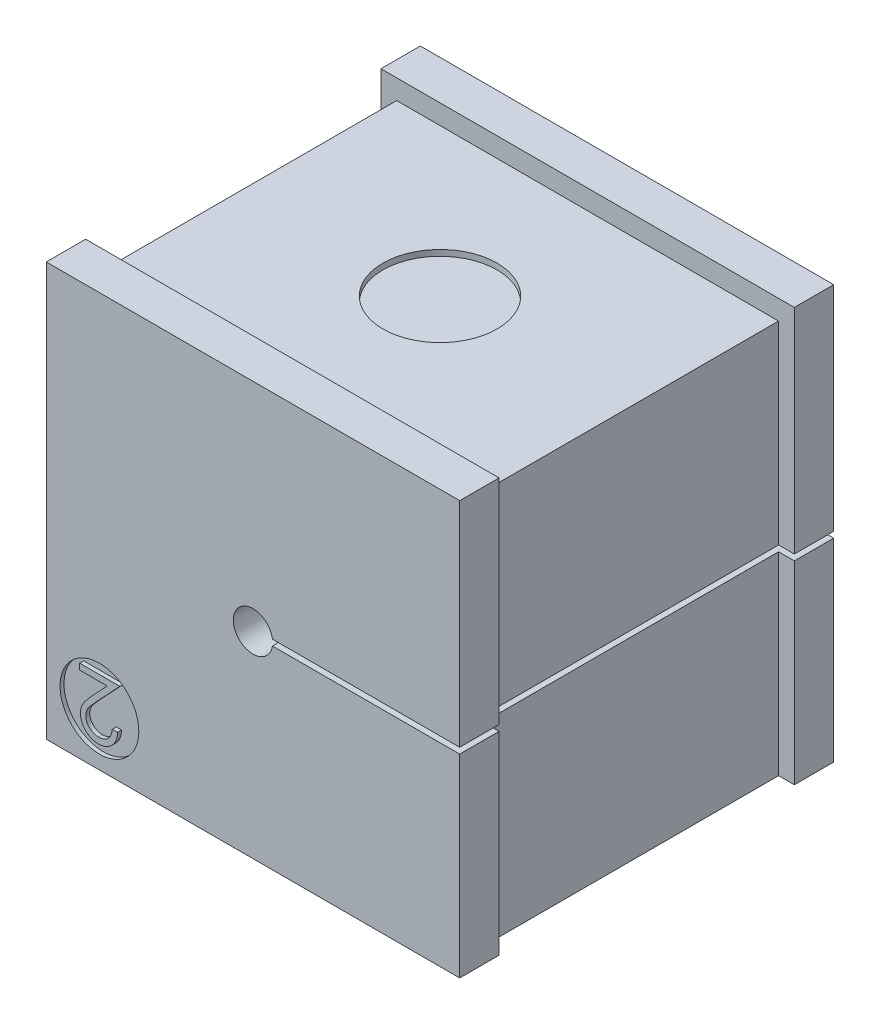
ISO-10303-21;
HEADER;
FILE_DESCRIPTION(('STEP AP214'),'2;1');
FILE_NAME('part.step','',(''),(''),'','','');
FILE_SCHEMA(('AUTOMOTIVE_DESIGN { 1 0 10303 214 1 1 1 1 }'));
ENDSEC;
DATA;
#1=APPLICATION_CONTEXT('core data for automotive mechanical design processes');
#2=APPLICATION_PROTOCOL_DEFINITION('international standard','automotive_design',2000,#1);
#3=PRODUCT_CONTEXT('',#1,'mechanical');
#4=PRODUCT('Part','Part','',(#3));
#5=PRODUCT_RELATED_PRODUCT_CATEGORY('part','',(#4));
#6=PRODUCT_DEFINITION_FORMATION('','',#4);
#7=PRODUCT_DEFINITION_CONTEXT('part definition',#1,'design');
#8=PRODUCT_DEFINITION('design','',#6,#7);
#9=PRODUCT_DEFINITION_SHAPE('','',#8);
#10=(LENGTH_UNIT() NAMED_UNIT(*) SI_UNIT(.MILLI.,.METRE.));
#11=(NAMED_UNIT(*) PLANE_ANGLE_UNIT() SI_UNIT($,.RADIAN.));
#12=(NAMED_UNIT(*) SI_UNIT($,.STERADIAN.) SOLID_ANGLE_UNIT());
#13=UNCERTAINTY_MEASURE_WITH_UNIT(LENGTH_MEASURE(1.E-05),#10,'distance_accuracy_value','');
#14=(GEOMETRIC_REPRESENTATION_CONTEXT(3) GLOBAL_UNCERTAINTY_ASSIGNED_CONTEXT((#13)) GLOBAL_UNIT_ASSIGNED_CONTEXT((#10,
#11,#12)) REPRESENTATION_CONTEXT('',''));
#15=CARTESIAN_POINT('',(0.,0.,0.));
#16=DIRECTION('',(0.,0.,1.));
#17=DIRECTION('',(1.,0.,0.));
#18=AXIS2_PLACEMENT_3D('',#15,#16,#17);
#19=CARTESIAN_POINT('',(3.15180335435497,-8.8722612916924,9.5));
#20=DIRECTION('',(0.,-9.42924395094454E-13,-1.));
#21=DIRECTION('',(0.,-1.,9.42924395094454E-13));
#22=AXIS2_PLACEMENT_3D('',#19,#20,#21);
#23=PLANE('',#22);
#24=CARTESIAN_POINT('',(2.65853365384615,-9.06923076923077,9.5));
#25=CARTESIAN_POINT('',(2.68200036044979,-9.06864225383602,9.5));
#26=CARTESIAN_POINT('',(2.72808509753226,-9.06748650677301,9.5));
#27=CARTESIAN_POINT('',(2.79560229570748,-9.0587268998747,9.5));
#28=CARTESIAN_POINT('',(2.86046231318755,-9.04546092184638,9.5));
#29=CARTESIAN_POINT('',(2.9216656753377,-9.02434159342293,9.5));
#30=CARTESIAN_POINT('',(2.98049325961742,-8.99962417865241,9.5));
#31=CARTESIAN_POINT('',(3.03544434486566,-8.96761947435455,9.5));
#32=CARTESIAN_POINT('',(3.0880625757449,-8.93104915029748,9.5));
#33=CARTESIAN_POINT('',(3.13729004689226,-8.88841047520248,9.5));
#34=CARTESIAN_POINT('',(3.18212563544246,-8.84027783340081,9.5));
#35=CARTESIAN_POINT('',(3.22291297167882,-8.78788630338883,9.5));
#36=CARTESIAN_POINT('',(3.25747248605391,-8.7303070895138,9.5));
#37=CARTESIAN_POINT('',(3.28815061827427,-8.66892182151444,9.5));
#38=CARTESIAN_POINT('',(3.31161333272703,-8.60204399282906,9.5));
#39=CARTESIAN_POINT('',(3.33167227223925,-8.5313091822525,9.5));
#40=CARTESIAN_POINT('',(3.34624279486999,-8.45570817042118,9.5));
#41=CARTESIAN_POINT('',(3.35126960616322,-8.40362095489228,9.5));
#42=CARTESIAN_POINT('',(3.35384615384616,-8.37692307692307,9.5));
#43=(BOUNDED_CURVE() B_SPLINE_CURVE(3,(#24,#25,#26,#27,#28,#29,#30,#31,#32,#33,#34,#35,#36,#37,
#38,#39,#40,#41,#42),.UNSPECIFIED.,.F.,.F.) B_SPLINE_CURVE_WITH_KNOTS((4,1,1,1,1,1,1,1,1,1,1,1,
1,1,1,1,4),(0.,0.0644420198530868,0.126553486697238,0.186778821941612,0.245943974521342,
0.304110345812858,0.361785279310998,0.42025540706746,0.479942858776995,0.540286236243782,
0.600712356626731,0.661962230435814,0.724472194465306,0.788881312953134,0.856306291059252,
0.926348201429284,1.),
.UNSPECIFIED.) CURVE() GEOMETRIC_REPRESENTATION_ITEM() RATIONAL_B_SPLINE_CURVE((1.,1.,1.,1.,1.,
1.,1.,1.,1.,1.,1.,1.,1.,1.,1.,1.,1.,1.,1.)) REPRESENTATION_ITEM(''));
#44=CARTESIAN_POINT('',(2.65853365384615,-9.06923076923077,9.5));
#45=VERTEX_POINT('',#44);
#46=CARTESIAN_POINT('',(3.35384615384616,-8.37692307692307,9.5));
#47=VERTEX_POINT('',#46);
#48=EDGE_CURVE('E388',#45,#47,#43,.T.);
#49=ORIENTED_EDGE('',*,*,#48,.F.);
#50=CARTESIAN_POINT('',(2.00769230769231,-8.46105769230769,9.5));
#51=CARTESIAN_POINT('',(2.00823163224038,-8.4815297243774,9.5));
#52=CARTESIAN_POINT('',(2.00929453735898,-8.52187616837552,9.5));
#53=CARTESIAN_POINT('',(2.01885287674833,-8.58099150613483,9.5));
#54=CARTESIAN_POINT('',(2.03289597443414,-8.63823624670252,9.5));
#55=CARTESIAN_POINT('',(2.0545407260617,-8.69290259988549,9.5));
#56=CARTESIAN_POINT('',(2.08054609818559,-8.74606574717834,9.5));
#57=CARTESIAN_POINT('',(2.1137698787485,-8.79610936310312,9.5));
#58=CARTESIAN_POINT('',(2.15173593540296,-8.84473931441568,9.5));
#59=CARTESIAN_POINT('',(2.19577469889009,-8.89028812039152,9.5));
#60=CARTESIAN_POINT('',(2.24412107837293,-8.93201789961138,9.5));
#61=CARTESIAN_POINT('',(2.29520352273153,-8.96898060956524,9.5));
#62=CARTESIAN_POINT('',(2.34924603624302,-8.9998714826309,9.5));
#63=CARTESIAN_POINT('',(2.4060233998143,-9.02519442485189,9.5));
#64=CARTESIAN_POINT('',(2.46537662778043,-9.04505905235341,9.5));
#65=CARTESIAN_POINT('',(2.52742070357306,-9.05882354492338,9.5));
#66=CARTESIAN_POINT('',(2.5919841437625,-9.0674656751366,9.5));
#67=CARTESIAN_POINT('',(2.63606999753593,-9.06863496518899,9.5));
#68=CARTESIAN_POINT('',(2.65853365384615,-9.06923076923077,9.5));
#69=(BOUNDED_CURVE() B_SPLINE_CURVE(3,(#50,#51,#52,#53,#54,#55,#56,#57,#58,#59,#60,#61,#62,#63,
#64,#65,#66,#67,#68),.UNSPECIFIED.,.F.,.F.) B_SPLINE_CURVE_WITH_KNOTS((4,1,1,1,1,1,1,1,1,1,1,1,
1,1,1,1,4),(0.,0.0619690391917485,0.122129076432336,0.180999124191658,0.240162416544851,
0.29986472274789,0.359951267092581,0.421741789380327,0.486545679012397,0.551508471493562,
0.614994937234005,0.677239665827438,0.739714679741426,0.803038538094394,0.866487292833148,
0.931969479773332,1.),
.UNSPECIFIED.) CURVE() GEOMETRIC_REPRESENTATION_ITEM() RATIONAL_B_SPLINE_CURVE((1.,1.,1.,1.,1.,
1.,1.,1.,1.,1.,1.,1.,1.,1.,1.,1.,1.,1.,1.)) REPRESENTATION_ITEM(''));
#70=CARTESIAN_POINT('',(2.00769230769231,-8.46105769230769,9.5));
#71=VERTEX_POINT('',#70);
#72=EDGE_CURVE('E312',#71,#45,#69,.T.);
#73=ORIENTED_EDGE('',*,*,#72,.F.);
#74=CARTESIAN_POINT('',(2.575,-7.54158653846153,9.5));
#75=CARTESIAN_POINT('',(2.54667123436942,-7.57115490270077,9.5));
#76=CARTESIAN_POINT('',(2.49225747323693,-7.62794967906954,9.5));
#77=CARTESIAN_POINT('',(2.41532736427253,-7.7108934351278,9.5));
#78=CARTESIAN_POINT('',(2.34612061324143,-7.78775115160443,9.5));
#79=CARTESIAN_POINT('',(2.28459131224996,-7.85886340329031,9.5));
#80=CARTESIAN_POINT('',(2.23068883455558,-7.92382705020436,9.5));
#81=CARTESIAN_POINT('',(2.18458564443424,-7.98315119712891,9.5));
#82=CARTESIAN_POINT('',(2.14607797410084,-8.03632674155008,9.5));
#83=CARTESIAN_POINT('',(2.10526786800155,-8.09879514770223,9.5));
#84=CARTESIAN_POINT('',(2.06635272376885,-8.17515588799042,9.5));
#85=CARTESIAN_POINT('',(2.03215029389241,-8.26800331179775,9.5));
#86=CARTESIAN_POINT('',(2.01144460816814,-8.36379382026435,9.5));
#87=CARTESIAN_POINT('',(2.0089480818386,-8.42850660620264,9.5));
#88=CARTESIAN_POINT('',(2.00769230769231,-8.46105769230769,9.5));
#89=(BOUNDED_CURVE() B_SPLINE_CURVE(3,(#74,#75,#76,#77,#78,#79,#80,#81,#82,#83,#84,#85,#86,#87,
#88),.UNSPECIFIED.,.F.,.F.) B_SPLINE_CURVE_WITH_KNOTS((4,1,1,1,1,1,1,1,1,1,1,1,4),(0.,
0.110794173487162,0.212812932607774,0.306077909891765,0.390617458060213,0.467232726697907,
0.534450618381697,0.59386680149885,0.644832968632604,0.736220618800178,0.825037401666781,
0.911992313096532,1.),
.UNSPECIFIED.) CURVE() GEOMETRIC_REPRESENTATION_ITEM() RATIONAL_B_SPLINE_CURVE((1.,1.,1.,1.,1.,
1.,1.,1.,1.,1.,1.,1.,1.,1.,1.)) REPRESENTATION_ITEM(''));
#90=CARTESIAN_POINT('',(2.575,-7.54158653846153,9.5));
#91=VERTEX_POINT('',#90);
#92=EDGE_CURVE('E409',#91,#71,#89,.T.);
#93=ORIENTED_EDGE('',*,*,#92,.F.);
#94=DIRECTION('',(-0.683776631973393,-0.729691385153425,0.));
#95=VECTOR('',#94,1.);
#96=CARTESIAN_POINT('',(3.73846153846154,-6.3,9.5));
#97=LINE('',#96,#95);
#98=CARTESIAN_POINT('',(3.73846153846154,-6.3,9.5));
#99=VERTEX_POINT('',#98);
#100=EDGE_CURVE('E333',#99,#91,#97,.T.);
#101=ORIENTED_EDGE('',*,*,#100,.F.);
#102=DIRECTION('',(1.,0.,0.));
#103=VECTOR('',#102,1.);
#104=CARTESIAN_POINT('',(1.7,-6.3,9.5));
#105=LINE('',#104,#103);
#106=CARTESIAN_POINT('',(1.7,-6.3,9.5));
#107=VERTEX_POINT('',#106);
#108=EDGE_CURVE('E332',#107,#99,#105,.T.);
#109=ORIENTED_EDGE('',*,*,#108,.F.);
#110=DIRECTION('',(0.,1.,0.));
#111=VECTOR('',#110,1.);
#112=CARTESIAN_POINT('',(1.7,-6.6076923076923,9.5));
#113=LINE('',#112,#111);
#114=CARTESIAN_POINT('',(1.7,-6.6076923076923,9.5));
#115=VERTEX_POINT('',#114);
#116=EDGE_CURVE('E1057',#115,#107,#113,.T.);
#117=ORIENTED_EDGE('',*,*,#116,.F.);
#118=DIRECTION('',(-1.,0.,0.));
#119=VECTOR('',#118,1.);
#120=CARTESIAN_POINT('',(3.09603365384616,-6.6076923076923,9.5));
#121=LINE('',#120,#119);
#122=CARTESIAN_POINT('',(3.09603365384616,-6.6076923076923,9.5));
#123=VERTEX_POINT('',#122);
#124=EDGE_CURVE('E182',#123,#115,#121,.T.);
#125=ORIENTED_EDGE('',*,*,#124,.F.);
#126=DIRECTION('',(0.683740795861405,0.729724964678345,0.));
#127=VECTOR('',#126,1.);
#128=CARTESIAN_POINT('',(2.34543269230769,-7.40877403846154,9.5));
#129=LINE('',#128,#127);
#130=CARTESIAN_POINT('',(2.34543269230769,-7.40877403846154,9.5));
#131=VERTEX_POINT('',#130);
#132=EDGE_CURVE('E178',#131,#123,#129,.T.);
#133=ORIENTED_EDGE('',*,*,#132,.F.);
#134=CARTESIAN_POINT('',(1.73846153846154,-8.48509615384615,9.5));
#135=CARTESIAN_POINT('',(1.73991292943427,-8.44331231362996,9.5));
#136=CARTESIAN_POINT('',(1.74279024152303,-8.3604778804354,9.5));
#137=CARTESIAN_POINT('',(1.76740222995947,-8.23875059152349,9.5));
#138=CARTESIAN_POINT('',(1.80584336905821,-8.12081437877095,9.5));
#139=CARTESIAN_POINT('',(1.85212271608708,-8.02589345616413,9.5));
#140=CARTESIAN_POINT('',(1.89882256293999,-7.94941484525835,9.5));
#141=CARTESIAN_POINT('',(1.94086381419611,-7.88641504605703,9.5));
#142=CARTESIAN_POINT('',(1.99035994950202,-7.81859905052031,9.5));
#143=CARTESIAN_POINT('',(2.04688809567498,-7.74569237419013,9.5));
#144=CARTESIAN_POINT('',(2.11142174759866,-7.66864979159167,9.5));
#145=CARTESIAN_POINT('',(2.18228432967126,-7.58589942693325,9.5));
#146=CARTESIAN_POINT('',(2.26130589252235,-7.49897139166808,9.5));
#147=CARTESIAN_POINT('',(2.31671900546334,-7.43955969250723,9.5));
#148=CARTESIAN_POINT('',(2.34543269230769,-7.40877403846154,9.5));
#149=(BOUNDED_CURVE() B_SPLINE_CURVE(3,(#134,#135,#136,#137,#138,#139,#140,#141,#142,#143,#144,
#145,#146,#147,#148),.UNSPECIFIED.,.F.,.F.) B_SPLINE_CURVE_WITH_KNOTS((4,1,1,1,1,1,1,1,1,1,1,1,
4),(0.,0.0987013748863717,0.195670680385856,0.292419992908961,0.391339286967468,
0.444458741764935,0.504224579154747,0.570347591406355,0.642913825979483,0.722289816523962,
0.807922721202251,0.900470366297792,1.),
.UNSPECIFIED.) CURVE() GEOMETRIC_REPRESENTATION_ITEM() RATIONAL_B_SPLINE_CURVE((1.,1.,1.,1.,1.,
1.,1.,1.,1.,1.,1.,1.,1.,1.,1.)) REPRESENTATION_ITEM(''));
#150=CARTESIAN_POINT('',(1.73846153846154,-8.48509615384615,9.5));
#151=VERTEX_POINT('',#150);
#152=EDGE_CURVE('E165',#151,#131,#149,.T.);
#153=ORIENTED_EDGE('',*,*,#152,.F.);
#154=CARTESIAN_POINT('',(2.64471153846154,-9.37692307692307,9.5));
#155=CARTESIAN_POINT('',(2.6118137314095,-9.3761592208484,9.5));
#156=CARTESIAN_POINT('',(2.54717071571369,-9.37465827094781,9.5));
#157=CARTESIAN_POINT('',(2.45286459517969,-9.36157469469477,9.5));
#158=CARTESIAN_POINT('',(2.36287393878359,-9.34152528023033,9.5));
#159=CARTESIAN_POINT('',(2.27821860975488,-9.31181520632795,9.5));
#160=CARTESIAN_POINT('',(2.19802980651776,-9.27453556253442,9.5));
#161=CARTESIAN_POINT('',(2.12330039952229,-9.22817344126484,9.5));
#162=CARTESIAN_POINT('',(2.0522233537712,-9.17492254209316,9.5));
#163=CARTESIAN_POINT('',(1.98828700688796,-9.11211049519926,9.5));
#164=CARTESIAN_POINT('',(1.92955375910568,-9.04508988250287,9.5));
#165=CARTESIAN_POINT('',(1.8789292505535,-8.97351243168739,9.5));
#166=CARTESIAN_POINT('',(1.83533102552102,-8.8994991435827,9.5));
#167=CARTESIAN_POINT('',(1.79964724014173,-8.82247186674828,9.5));
#168=CARTESIAN_POINT('',(1.7725973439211,-8.742179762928,9.5));
#169=CARTESIAN_POINT('',(1.75255596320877,-8.65939261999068,9.5));
#170=CARTESIAN_POINT('',(1.74109922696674,-8.57315501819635,9.5));
#171=CARTESIAN_POINT('',(1.73935056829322,-8.51477629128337,9.5));
#172=CARTESIAN_POINT('',(1.73846153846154,-8.48509615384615,9.5));
#173=(BOUNDED_CURVE() B_SPLINE_CURVE(3,(#154,#155,#156,#157,#158,#159,#160,#161,#162,#163,#164,
#165,#166,#167,#168,#169,#170,#171,#172),.UNSPECIFIED.,.F.,.F.) B_SPLINE_CURVE_WITH_KNOTS((4,1,
1,1,1,1,1,1,1,1,1,1,1,1,1,1,4),(0.,0.0694796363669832,0.136525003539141,0.200800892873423,
0.263983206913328,0.325711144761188,0.387270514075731,0.449492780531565,0.51295519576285,
0.576266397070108,0.637574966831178,0.697901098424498,0.757558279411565,0.816587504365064,
0.876645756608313,0.937285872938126,1.),
.UNSPECIFIED.) CURVE() GEOMETRIC_REPRESENTATION_ITEM() RATIONAL_B_SPLINE_CURVE((1.,1.,1.,1.,1.,
1.,1.,1.,1.,1.,1.,1.,1.,1.,1.,1.,1.,1.,1.)) REPRESENTATION_ITEM(''));
#174=CARTESIAN_POINT('',(2.64471153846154,-9.37692307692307,9.5));
#175=VERTEX_POINT('',#174);
#176=EDGE_CURVE('E219',#175,#151,#173,.T.);
#177=ORIENTED_EDGE('',*,*,#176,.F.);
#178=CARTESIAN_POINT('',(3.62307692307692,-8.37692307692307,9.5));
#179=CARTESIAN_POINT('',(3.62132251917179,-8.41264115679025,9.5));
#180=CARTESIAN_POINT('',(3.61787691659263,-8.48279051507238,9.5));
#181=CARTESIAN_POINT('',(3.60173415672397,-8.58506565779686,9.5));
#182=CARTESIAN_POINT('',(3.57865727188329,-8.68283593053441,9.5));
#183=CARTESIAN_POINT('',(3.54595194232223,-8.77526313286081,9.5));
#184=CARTESIAN_POINT('',(3.50556371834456,-8.86345138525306,9.5));
#185=CARTESIAN_POINT('',(3.45611684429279,-8.94622964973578,9.5));
#186=CARTESIAN_POINT('',(3.39866544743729,-9.02441949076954,9.5));
#187=CARTESIAN_POINT('',(3.33331492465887,-9.09654051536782,9.5));
#188=CARTESIAN_POINT('',(3.26240358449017,-9.16246814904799,9.5));
#189=CARTESIAN_POINT('',(3.18635629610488,-9.22000250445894,9.5));
#190=CARTESIAN_POINT('',(3.10595468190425,-9.26805723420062,9.5));
#191=CARTESIAN_POINT('',(3.0218961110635,-9.30844834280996,9.5));
#192=CARTESIAN_POINT('',(2.93320842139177,-9.33872996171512,9.5));
#193=CARTESIAN_POINT('',(2.84073936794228,-9.36120829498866,9.5));
#194=CARTESIAN_POINT('',(2.74407100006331,-9.37473015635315,9.5));
#195=CARTESIAN_POINT('',(2.67820819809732,-9.37618378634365,9.5));
#196=CARTESIAN_POINT('',(2.64471153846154,-9.37692307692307,9.5));
#197=(BOUNDED_CURVE() B_SPLINE_CURVE(3,(#178,#179,#180,#181,#182,#183,#184,#185,#186,#187,#188,
#189,#190,#191,#192,#193,#194,#195,#196),.UNSPECIFIED.,.F.,.F.) B_SPLINE_CURVE_WITH_KNOTS((4,1,
1,1,1,1,1,1,1,1,1,1,1,1,1,1,4),(0.,0.0687985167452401,0.135118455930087,0.199001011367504,
0.261933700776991,0.323531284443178,0.385434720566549,0.447215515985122,0.510018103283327,
0.572510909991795,0.633364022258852,0.693216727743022,0.752555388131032,0.81255822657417,
0.873260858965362,0.935542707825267,1.),
.UNSPECIFIED.) CURVE() GEOMETRIC_REPRESENTATION_ITEM() RATIONAL_B_SPLINE_CURVE((1.,1.,1.,1.,1.,
1.,1.,1.,1.,1.,1.,1.,1.,1.,1.,1.,1.,1.,1.)) REPRESENTATION_ITEM(''));
#198=CARTESIAN_POINT('',(3.62307692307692,-8.37692307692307,9.5));
#199=VERTEX_POINT('',#198);
#200=EDGE_CURVE('E23',#199,#175,#197,.T.);
#201=ORIENTED_EDGE('',*,*,#200,.F.);
#202=DIRECTION('',(1.,0.,0.));
#203=VECTOR('',#202,1.);
#204=CARTESIAN_POINT('',(3.35384615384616,-8.37692307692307,9.5));
#205=LINE('',#204,#203);
#206=EDGE_CURVE('E9',#47,#199,#205,.T.);
#207=ORIENTED_EDGE('',*,*,#206,.F.);
#208=EDGE_LOOP('',(#49,#73,#93,#101,#109,#117,#125,#133,#153,#177,#201,#207));
#209=FACE_BOUND('',#208,.T.);
#210=ADVANCED_FACE('F15',(#209),#23,.F.);
#211=CARTESIAN_POINT('',(3.35384615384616,-8.37692307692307,9.5));
#212=DIRECTION('',(0.,1.,0.));
#213=DIRECTION('',(1.,0.,0.));
#214=AXIS2_PLACEMENT_3D('',#211,#212,#213);
#215=PLANE('',#214);
#216=DIRECTION('',(1.,0.,0.));
#217=VECTOR('',#216,1.);
#218=CARTESIAN_POINT('',(3.35384615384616,-8.37692307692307,9.3));
#219=LINE('',#218,#217);
#220=CARTESIAN_POINT('',(3.35384615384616,-8.37692307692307,9.3));
#221=VERTEX_POINT('',#220);
#222=CARTESIAN_POINT('',(3.62307692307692,-8.37692307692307,9.3));
#223=VERTEX_POINT('',#222);
#224=EDGE_CURVE('E237',#221,#223,#219,.T.);
#225=ORIENTED_EDGE('',*,*,#224,.F.);
#226=DIRECTION('',(0.,0.,-1.));
#227=VECTOR('',#226,1.);
#228=CARTESIAN_POINT('',(3.35384615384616,-8.37692307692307,9.5));
#229=LINE('',#228,#227);
#230=EDGE_CURVE('E313',#47,#221,#229,.T.);
#231=ORIENTED_EDGE('',*,*,#230,.F.);
#232=ORIENTED_EDGE('',*,*,#206,.T.);
#233=DIRECTION('',(0.,0.,-1.));
#234=VECTOR('',#233,1.);
#235=CARTESIAN_POINT('',(3.62307692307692,-8.37692307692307,9.5));
#236=LINE('',#235,#234);
#237=EDGE_CURVE('E216',#199,#223,#236,.T.);
#238=ORIENTED_EDGE('',*,*,#237,.T.);
#239=EDGE_LOOP('',(#225,#231,#232,#238));
#240=FACE_BOUND('',#239,.T.);
#241=ADVANCED_FACE('F798',(#240),#215,.T.);
#242=CARTESIAN_POINT('',(3.62307692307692,-8.37692307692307,9.5));
#243=CARTESIAN_POINT('',(3.62307692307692,-8.37692307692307,9.3));
#244=CARTESIAN_POINT('',(3.62132251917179,-8.41264115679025,9.5));
#245=CARTESIAN_POINT('',(3.62132251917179,-8.41264115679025,9.3));
#246=CARTESIAN_POINT('',(3.61787691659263,-8.48279051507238,9.5));
#247=CARTESIAN_POINT('',(3.61787691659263,-8.48279051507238,9.3));
#248=CARTESIAN_POINT('',(3.60173415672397,-8.58506565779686,9.5));
#249=CARTESIAN_POINT('',(3.60173415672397,-8.58506565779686,9.3));
#250=CARTESIAN_POINT('',(3.57865727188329,-8.68283593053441,9.5));
#251=CARTESIAN_POINT('',(3.57865727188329,-8.68283593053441,9.3));
#252=CARTESIAN_POINT('',(3.54595194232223,-8.77526313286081,9.5));
#253=CARTESIAN_POINT('',(3.54595194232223,-8.77526313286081,9.3));
#254=CARTESIAN_POINT('',(3.50556371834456,-8.86345138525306,9.5));
#255=CARTESIAN_POINT('',(3.50556371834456,-8.86345138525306,9.3));
#256=CARTESIAN_POINT('',(3.45611684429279,-8.94622964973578,9.5));
#257=CARTESIAN_POINT('',(3.45611684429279,-8.94622964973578,9.3));
#258=CARTESIAN_POINT('',(3.39866544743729,-9.02441949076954,9.5));
#259=CARTESIAN_POINT('',(3.39866544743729,-9.02441949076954,9.3));
#260=CARTESIAN_POINT('',(3.33331492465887,-9.09654051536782,9.5));
#261=CARTESIAN_POINT('',(3.33331492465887,-9.09654051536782,9.3));
#262=CARTESIAN_POINT('',(3.26240358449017,-9.16246814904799,9.5));
#263=CARTESIAN_POINT('',(3.26240358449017,-9.16246814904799,9.3));
#264=CARTESIAN_POINT('',(3.18635629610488,-9.22000250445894,9.5));
#265=CARTESIAN_POINT('',(3.18635629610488,-9.22000250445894,9.3));
#266=CARTESIAN_POINT('',(3.10595468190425,-9.26805723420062,9.5));
#267=CARTESIAN_POINT('',(3.10595468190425,-9.26805723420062,9.3));
#268=CARTESIAN_POINT('',(3.0218961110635,-9.30844834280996,9.5));
#269=CARTESIAN_POINT('',(3.0218961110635,-9.30844834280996,9.3));
#270=CARTESIAN_POINT('',(2.93320842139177,-9.33872996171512,9.5));
#271=CARTESIAN_POINT('',(2.93320842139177,-9.33872996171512,9.3));
#272=CARTESIAN_POINT('',(2.84073936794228,-9.36120829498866,9.5));
#273=CARTESIAN_POINT('',(2.84073936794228,-9.36120829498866,9.3));
#274=CARTESIAN_POINT('',(2.74407100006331,-9.37473015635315,9.5));
#275=CARTESIAN_POINT('',(2.74407100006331,-9.37473015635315,9.3));
#276=CARTESIAN_POINT('',(2.67820819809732,-9.37618378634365,9.5));
#277=CARTESIAN_POINT('',(2.67820819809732,-9.37618378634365,9.3));
#278=CARTESIAN_POINT('',(2.64471153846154,-9.37692307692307,9.5));
#279=CARTESIAN_POINT('',(2.64471153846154,-9.37692307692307,9.3));
#280=(BOUNDED_SURFACE() B_SPLINE_SURFACE(3,1,((#242,#243),(#244,#245),(#246,#247),(#248,#249),
(#250,#251),(#252,#253),(#254,#255),(#256,#257),(#258,#259),(#260,#261),(#262,#263),(#264,#265),
(#266,#267),(#268,#269),(#270,#271),(#272,#273),(#274,#275),(#276,#277),(#278,#279)),
.UNSPECIFIED.,.F.,.F.,.F.) B_SPLINE_SURFACE_WITH_KNOTS((4,1,1,1,1,1,1,1,1,1,1,1,1,1,1,1,4),(2,
2),(0.,0.0687985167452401,0.135118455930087,0.199001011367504,0.261933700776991,
0.323531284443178,0.385434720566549,0.447215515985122,0.510018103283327,0.572510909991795,
0.633364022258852,0.693216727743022,0.752555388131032,0.81255822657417,0.873260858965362,
0.935542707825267,1.),(0.,1.),
.UNSPECIFIED.) GEOMETRIC_REPRESENTATION_ITEM() RATIONAL_B_SPLINE_SURFACE(((1.,1.),(1.,1.),(1.,
1.),(1.,1.),(1.,1.),(1.,1.),(1.,1.),(1.,1.),(1.,1.),(1.,1.),(1.,1.),(1.,1.),(1.,1.),(1.,1.),(1.,
1.),(1.,1.),(1.,1.),(1.,1.),(1.,1.))) REPRESENTATION_ITEM('') SURFACE());
#281=CARTESIAN_POINT('',(3.62307692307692,-8.37692307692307,9.3));
#282=CARTESIAN_POINT('',(3.62132251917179,-8.41264115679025,9.3));
#283=CARTESIAN_POINT('',(3.61787691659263,-8.48279051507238,9.3));
#284=CARTESIAN_POINT('',(3.60173415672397,-8.58506565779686,9.3));
#285=CARTESIAN_POINT('',(3.57865727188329,-8.68283593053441,9.3));
#286=CARTESIAN_POINT('',(3.54595194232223,-8.77526313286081,9.3));
#287=CARTESIAN_POINT('',(3.50556371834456,-8.86345138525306,9.3));
#288=CARTESIAN_POINT('',(3.45611684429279,-8.94622964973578,9.3));
#289=CARTESIAN_POINT('',(3.39866544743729,-9.02441949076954,9.3));
#290=CARTESIAN_POINT('',(3.33331492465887,-9.09654051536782,9.3));
#291=CARTESIAN_POINT('',(3.26240358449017,-9.16246814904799,9.3));
#292=CARTESIAN_POINT('',(3.18635629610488,-9.22000250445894,9.3));
#293=CARTESIAN_POINT('',(3.10595468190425,-9.26805723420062,9.3));
#294=CARTESIAN_POINT('',(3.0218961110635,-9.30844834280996,9.3));
#295=CARTESIAN_POINT('',(2.93320842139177,-9.33872996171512,9.3));
#296=CARTESIAN_POINT('',(2.84073936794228,-9.36120829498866,9.3));
#297=CARTESIAN_POINT('',(2.74407100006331,-9.37473015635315,9.3));
#298=CARTESIAN_POINT('',(2.67820819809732,-9.37618378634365,9.3));
#299=CARTESIAN_POINT('',(2.64471153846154,-9.37692307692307,9.3));
#300=(BOUNDED_CURVE() B_SPLINE_CURVE(3,(#281,#282,#283,#284,#285,#286,#287,#288,#289,#290,#291,
#292,#293,#294,#295,#296,#297,#298,#299),.UNSPECIFIED.,.F.,.F.) B_SPLINE_CURVE_WITH_KNOTS((4,1,
1,1,1,1,1,1,1,1,1,1,1,1,1,1,4),(0.,0.0687985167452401,0.135118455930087,0.199001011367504,
0.261933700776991,0.323531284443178,0.385434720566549,0.447215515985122,0.510018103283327,
0.572510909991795,0.633364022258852,0.693216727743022,0.752555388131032,0.81255822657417,
0.873260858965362,0.935542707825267,1.),
.UNSPECIFIED.) CURVE() GEOMETRIC_REPRESENTATION_ITEM() RATIONAL_B_SPLINE_CURVE((1.,1.,1.,1.,1.,
1.,1.,1.,1.,1.,1.,1.,1.,1.,1.,1.,1.,1.,1.)) REPRESENTATION_ITEM(''));
#301=CARTESIAN_POINT('',(2.64471153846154,-9.37692307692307,9.3));
#302=VERTEX_POINT('',#301);
#303=EDGE_CURVE('E241',#223,#302,#300,.T.);
#304=DIRECTION('',(0.,0.,-1.));
#305=VECTOR('',#304,1.);
#306=CARTESIAN_POINT('',(2.64471153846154,-9.37692307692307,9.5));
#307=LINE('',#306,#305);
#308=EDGE_CURVE('E175',#175,#302,#307,.T.);
#309=ORIENTED_EDGE('',*,*,#303,.F.);
#310=ORIENTED_EDGE('',*,*,#237,.F.);
#311=ORIENTED_EDGE('',*,*,#200,.T.);
#312=ORIENTED_EDGE('',*,*,#308,.T.);
#313=EDGE_LOOP('',(#309,#310,#311,#312));
#314=FACE_BOUND('',#313,.T.);
#315=ADVANCED_FACE('F788',(#314),#280,.T.);
#316=CARTESIAN_POINT('',(2.64471153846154,-9.37692307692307,9.5));
#317=CARTESIAN_POINT('',(2.64471153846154,-9.37692307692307,9.3));
#318=CARTESIAN_POINT('',(2.6118137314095,-9.3761592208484,9.5));
#319=CARTESIAN_POINT('',(2.6118137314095,-9.3761592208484,9.3));
#320=CARTESIAN_POINT('',(2.54717071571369,-9.37465827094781,9.5));
#321=CARTESIAN_POINT('',(2.54717071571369,-9.37465827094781,9.3));
#322=CARTESIAN_POINT('',(2.45286459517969,-9.36157469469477,9.5));
#323=CARTESIAN_POINT('',(2.45286459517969,-9.36157469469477,9.3));
#324=CARTESIAN_POINT('',(2.36287393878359,-9.34152528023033,9.5));
#325=CARTESIAN_POINT('',(2.36287393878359,-9.34152528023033,9.3));
#326=CARTESIAN_POINT('',(2.27821860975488,-9.31181520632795,9.5));
#327=CARTESIAN_POINT('',(2.27821860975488,-9.31181520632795,9.3));
#328=CARTESIAN_POINT('',(2.19802980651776,-9.27453556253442,9.5));
#329=CARTESIAN_POINT('',(2.19802980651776,-9.27453556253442,9.3));
#330=CARTESIAN_POINT('',(2.12330039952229,-9.22817344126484,9.5));
#331=CARTESIAN_POINT('',(2.12330039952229,-9.22817344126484,9.3));
#332=CARTESIAN_POINT('',(2.0522233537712,-9.17492254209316,9.5));
#333=CARTESIAN_POINT('',(2.0522233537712,-9.17492254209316,9.3));
#334=CARTESIAN_POINT('',(1.98828700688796,-9.11211049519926,9.5));
#335=CARTESIAN_POINT('',(1.98828700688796,-9.11211049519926,9.3));
#336=CARTESIAN_POINT('',(1.92955375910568,-9.04508988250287,9.5));
#337=CARTESIAN_POINT('',(1.92955375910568,-9.04508988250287,9.3));
#338=CARTESIAN_POINT('',(1.8789292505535,-8.97351243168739,9.5));
#339=CARTESIAN_POINT('',(1.8789292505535,-8.97351243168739,9.3));
#340=CARTESIAN_POINT('',(1.83533102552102,-8.8994991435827,9.5));
#341=CARTESIAN_POINT('',(1.83533102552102,-8.8994991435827,9.3));
#342=CARTESIAN_POINT('',(1.79964724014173,-8.82247186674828,9.5));
#343=CARTESIAN_POINT('',(1.79964724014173,-8.82247186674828,9.3));
#344=CARTESIAN_POINT('',(1.7725973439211,-8.742179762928,9.5));
#345=CARTESIAN_POINT('',(1.7725973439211,-8.742179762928,9.3));
#346=CARTESIAN_POINT('',(1.75255596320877,-8.65939261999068,9.5));
#347=CARTESIAN_POINT('',(1.75255596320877,-8.65939261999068,9.3));
#348=CARTESIAN_POINT('',(1.74109922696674,-8.57315501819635,9.5));
#349=CARTESIAN_POINT('',(1.74109922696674,-8.57315501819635,9.3));
#350=CARTESIAN_POINT('',(1.73935056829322,-8.51477629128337,9.5));
#351=CARTESIAN_POINT('',(1.73935056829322,-8.51477629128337,9.3));
#352=CARTESIAN_POINT('',(1.73846153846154,-8.48509615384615,9.5));
#353=CARTESIAN_POINT('',(1.73846153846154,-8.48509615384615,9.3));
#354=(BOUNDED_SURFACE() B_SPLINE_SURFACE(3,1,((#316,#317),(#318,#319),(#320,#321),(#322,#323),
(#324,#325),(#326,#327),(#328,#329),(#330,#331),(#332,#333),(#334,#335),(#336,#337),(#338,#339),
(#340,#341),(#342,#343),(#344,#345),(#346,#347),(#348,#349),(#350,#351),(#352,#353)),
.UNSPECIFIED.,.F.,.F.,.F.) B_SPLINE_SURFACE_WITH_KNOTS((4,1,1,1,1,1,1,1,1,1,1,1,1,1,1,1,4),(2,
2),(0.,0.0694796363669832,0.136525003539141,0.200800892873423,0.263983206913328,
0.325711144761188,0.387270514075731,0.449492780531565,0.51295519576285,0.576266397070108,
0.637574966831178,0.697901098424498,0.757558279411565,0.816587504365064,0.876645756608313,
0.937285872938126,1.),(0.,1.),
.UNSPECIFIED.) GEOMETRIC_REPRESENTATION_ITEM() RATIONAL_B_SPLINE_SURFACE(((1.,1.),(1.,1.),(1.,
1.),(1.,1.),(1.,1.),(1.,1.),(1.,1.),(1.,1.),(1.,1.),(1.,1.),(1.,1.),(1.,1.),(1.,1.),(1.,1.),(1.,
1.),(1.,1.),(1.,1.),(1.,1.),(1.,1.))) REPRESENTATION_ITEM('') SURFACE());
#355=CARTESIAN_POINT('',(2.64471153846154,-9.37692307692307,9.3));
#356=CARTESIAN_POINT('',(2.6118137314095,-9.3761592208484,9.3));
#357=CARTESIAN_POINT('',(2.54717071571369,-9.37465827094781,9.3));
#358=CARTESIAN_POINT('',(2.45286459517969,-9.36157469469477,9.3));
#359=CARTESIAN_POINT('',(2.36287393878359,-9.34152528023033,9.3));
#360=CARTESIAN_POINT('',(2.27821860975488,-9.31181520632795,9.3));
#361=CARTESIAN_POINT('',(2.19802980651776,-9.27453556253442,9.3));
#362=CARTESIAN_POINT('',(2.12330039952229,-9.22817344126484,9.3));
#363=CARTESIAN_POINT('',(2.0522233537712,-9.17492254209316,9.3));
#364=CARTESIAN_POINT('',(1.98828700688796,-9.11211049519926,9.3));
#365=CARTESIAN_POINT('',(1.92955375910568,-9.04508988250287,9.3));
#366=CARTESIAN_POINT('',(1.8789292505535,-8.97351243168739,9.3));
#367=CARTESIAN_POINT('',(1.83533102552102,-8.8994991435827,9.3));
#368=CARTESIAN_POINT('',(1.79964724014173,-8.82247186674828,9.3));
#369=CARTESIAN_POINT('',(1.7725973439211,-8.742179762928,9.3));
#370=CARTESIAN_POINT('',(1.75255596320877,-8.65939261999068,9.3));
#371=CARTESIAN_POINT('',(1.74109922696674,-8.57315501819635,9.3));
#372=CARTESIAN_POINT('',(1.73935056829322,-8.51477629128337,9.3));
#373=CARTESIAN_POINT('',(1.73846153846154,-8.48509615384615,9.3));
#374=(BOUNDED_CURVE() B_SPLINE_CURVE(3,(#355,#356,#357,#358,#359,#360,#361,#362,#363,#364,#365,
#366,#367,#368,#369,#370,#371,#372,#373),.UNSPECIFIED.,.F.,.F.) B_SPLINE_CURVE_WITH_KNOTS((4,1,
1,1,1,1,1,1,1,1,1,1,1,1,1,1,4),(0.,0.0694796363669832,0.136525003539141,0.200800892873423,
0.263983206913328,0.325711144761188,0.387270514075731,0.449492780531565,0.51295519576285,
0.576266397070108,0.637574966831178,0.697901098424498,0.757558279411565,0.816587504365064,
0.876645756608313,0.937285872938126,1.),
.UNSPECIFIED.) CURVE() GEOMETRIC_REPRESENTATION_ITEM() RATIONAL_B_SPLINE_CURVE((1.,1.,1.,1.,1.,
1.,1.,1.,1.,1.,1.,1.,1.,1.,1.,1.,1.,1.,1.)) REPRESENTATION_ITEM(''));
#375=CARTESIAN_POINT('',(1.73846153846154,-8.48509615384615,9.3));
#376=VERTEX_POINT('',#375);
#377=EDGE_CURVE('E229',#302,#376,#374,.T.);
#378=DIRECTION('',(0.,0.,-1.));
#379=VECTOR('',#378,1.);
#380=CARTESIAN_POINT('',(1.73846153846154,-8.48509615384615,9.5));
#381=LINE('',#380,#379);
#382=EDGE_CURVE('E172',#151,#376,#381,.T.);
#383=ORIENTED_EDGE('',*,*,#377,.F.);
#384=ORIENTED_EDGE('',*,*,#308,.F.);
#385=ORIENTED_EDGE('',*,*,#176,.T.);
#386=ORIENTED_EDGE('',*,*,#382,.T.);
#387=EDGE_LOOP('',(#383,#384,#385,#386));
#388=FACE_BOUND('',#387,.T.);
#389=ADVANCED_FACE('F779',(#388),#354,.T.);
#390=CARTESIAN_POINT('',(1.73846153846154,-8.48509615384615,9.5));
#391=CARTESIAN_POINT('',(1.73846153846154,-8.48509615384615,9.3));
#392=CARTESIAN_POINT('',(1.73991292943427,-8.44331231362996,9.5));
#393=CARTESIAN_POINT('',(1.73991292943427,-8.44331231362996,9.3));
#394=CARTESIAN_POINT('',(1.74279024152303,-8.3604778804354,9.5));
#395=CARTESIAN_POINT('',(1.74279024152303,-8.3604778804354,9.3));
#396=CARTESIAN_POINT('',(1.76740222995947,-8.23875059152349,9.5));
#397=CARTESIAN_POINT('',(1.76740222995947,-8.23875059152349,9.3));
#398=CARTESIAN_POINT('',(1.80584336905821,-8.12081437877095,9.5));
#399=CARTESIAN_POINT('',(1.80584336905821,-8.12081437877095,9.3));
#400=CARTESIAN_POINT('',(1.85212271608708,-8.02589345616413,9.5));
#401=CARTESIAN_POINT('',(1.85212271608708,-8.02589345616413,9.3));
#402=CARTESIAN_POINT('',(1.89882256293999,-7.94941484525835,9.5));
#403=CARTESIAN_POINT('',(1.89882256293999,-7.94941484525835,9.3));
#404=CARTESIAN_POINT('',(1.94086381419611,-7.88641504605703,9.5));
#405=CARTESIAN_POINT('',(1.94086381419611,-7.88641504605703,9.3));
#406=CARTESIAN_POINT('',(1.99035994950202,-7.81859905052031,9.5));
#407=CARTESIAN_POINT('',(1.99035994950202,-7.81859905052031,9.3));
#408=CARTESIAN_POINT('',(2.04688809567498,-7.74569237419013,9.5));
#409=CARTESIAN_POINT('',(2.04688809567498,-7.74569237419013,9.3));
#410=CARTESIAN_POINT('',(2.11142174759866,-7.66864979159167,9.5));
#411=CARTESIAN_POINT('',(2.11142174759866,-7.66864979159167,9.3));
#412=CARTESIAN_POINT('',(2.18228432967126,-7.58589942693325,9.5));
#413=CARTESIAN_POINT('',(2.18228432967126,-7.58589942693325,9.3));
#414=CARTESIAN_POINT('',(2.26130589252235,-7.49897139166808,9.5));
#415=CARTESIAN_POINT('',(2.26130589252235,-7.49897139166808,9.3));
#416=CARTESIAN_POINT('',(2.31671900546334,-7.43955969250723,9.5));
#417=CARTESIAN_POINT('',(2.31671900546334,-7.43955969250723,9.3));
#418=CARTESIAN_POINT('',(2.34543269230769,-7.40877403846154,9.5));
#419=CARTESIAN_POINT('',(2.34543269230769,-7.40877403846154,9.3));
#420=(BOUNDED_SURFACE() B_SPLINE_SURFACE(3,1,((#390,#391),(#392,#393),(#394,#395),(#396,#397),
(#398,#399),(#400,#401),(#402,#403),(#404,#405),(#406,#407),(#408,#409),(#410,#411),(#412,#413),
(#414,#415),(#416,#417),(#418,#419)),.UNSPECIFIED.,.F.,.F.,.F.) B_SPLINE_SURFACE_WITH_KNOTS((4,
1,1,1,1,1,1,1,1,1,1,1,4),(2,2),(0.,0.0987013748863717,0.195670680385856,0.292419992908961,
0.391339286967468,0.444458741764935,0.504224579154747,0.570347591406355,0.642913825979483,
0.722289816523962,0.807922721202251,0.900470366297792,1.),(0.,1.),
.UNSPECIFIED.) GEOMETRIC_REPRESENTATION_ITEM() RATIONAL_B_SPLINE_SURFACE(((1.,1.),(1.,1.),(1.,
1.),(1.,1.),(1.,1.),(1.,1.),(1.,1.),(1.,1.),(1.,1.),(1.,1.),(1.,1.),(1.,1.),(1.,1.),(1.,1.),(1.,1.))) REPRESENTATION_ITEM('') SURFACE());
#421=CARTESIAN_POINT('',(1.73846153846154,-8.48509615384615,9.3));
#422=CARTESIAN_POINT('',(1.73991292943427,-8.44331231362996,9.3));
#423=CARTESIAN_POINT('',(1.74279024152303,-8.3604778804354,9.3));
#424=CARTESIAN_POINT('',(1.76740222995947,-8.23875059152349,9.3));
#425=CARTESIAN_POINT('',(1.80584336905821,-8.12081437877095,9.3));
#426=CARTESIAN_POINT('',(1.85212271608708,-8.02589345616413,9.3));
#427=CARTESIAN_POINT('',(1.89882256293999,-7.94941484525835,9.3));
#428=CARTESIAN_POINT('',(1.94086381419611,-7.88641504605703,9.3));
#429=CARTESIAN_POINT('',(1.99035994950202,-7.81859905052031,9.3));
#430=CARTESIAN_POINT('',(2.04688809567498,-7.74569237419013,9.3));
#431=CARTESIAN_POINT('',(2.11142174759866,-7.66864979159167,9.3));
#432=CARTESIAN_POINT('',(2.18228432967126,-7.58589942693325,9.3));
#433=CARTESIAN_POINT('',(2.26130589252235,-7.49897139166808,9.3));
#434=CARTESIAN_POINT('',(2.31671900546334,-7.43955969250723,9.3));
#435=CARTESIAN_POINT('',(2.34543269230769,-7.40877403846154,9.3));
#436=(BOUNDED_CURVE() B_SPLINE_CURVE(3,(#421,#422,#423,#424,#425,#426,#427,#428,#429,#430,#431,
#432,#433,#434,#435),.UNSPECIFIED.,.F.,.F.) B_SPLINE_CURVE_WITH_KNOTS((4,1,1,1,1,1,1,1,1,1,1,1,
4),(0.,0.0987013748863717,0.195670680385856,0.292419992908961,0.391339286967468,
0.444458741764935,0.504224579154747,0.570347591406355,0.642913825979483,0.722289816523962,
0.807922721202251,0.900470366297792,1.),
.UNSPECIFIED.) CURVE() GEOMETRIC_REPRESENTATION_ITEM() RATIONAL_B_SPLINE_CURVE((1.,1.,1.,1.,1.,
1.,1.,1.,1.,1.,1.,1.,1.,1.,1.)) REPRESENTATION_ITEM(''));
#437=CARTESIAN_POINT('',(2.34543269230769,-7.40877403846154,9.3));
#438=VERTEX_POINT('',#437);
#439=EDGE_CURVE('E224',#376,#438,#436,.T.);
#440=DIRECTION('',(0.,0.,-1.));
#441=VECTOR('',#440,1.);
#442=CARTESIAN_POINT('',(2.34543269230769,-7.40877403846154,9.5));
#443=LINE('',#442,#441);
#444=EDGE_CURVE('E170',#131,#438,#443,.T.);
#445=ORIENTED_EDGE('',*,*,#439,.F.);
#446=ORIENTED_EDGE('',*,*,#382,.F.);
#447=ORIENTED_EDGE('',*,*,#152,.T.);
#448=ORIENTED_EDGE('',*,*,#444,.T.);
#449=EDGE_LOOP('',(#445,#446,#447,#448));
#450=FACE_BOUND('',#449,.T.);
#451=ADVANCED_FACE('F168',(#450),#420,.T.);
#452=CARTESIAN_POINT('',(2.34543269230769,-7.40877403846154,9.5));
#453=DIRECTION('',(-0.729724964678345,0.683740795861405,0.));
#454=DIRECTION('',(0.,0.,1.));
#455=AXIS2_PLACEMENT_3D('',#452,#453,#454);
#456=PLANE('',#455);
#457=DIRECTION('',(0.683740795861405,0.729724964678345,0.));
#458=VECTOR('',#457,1.);
#459=CARTESIAN_POINT('',(2.34543269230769,-7.40877403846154,9.3));
#460=LINE('',#459,#458);
#461=CARTESIAN_POINT('',(3.09603365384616,-6.6076923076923,9.3));
#462=VERTEX_POINT('',#461);
#463=EDGE_CURVE('E189',#438,#462,#460,.T.);
#464=ORIENTED_EDGE('',*,*,#463,.F.);
#465=ORIENTED_EDGE('',*,*,#444,.F.);
#466=ORIENTED_EDGE('',*,*,#132,.T.);
#467=DIRECTION('',(0.,0.,-1.));
#468=VECTOR('',#467,1.);
#469=CARTESIAN_POINT('',(3.09603365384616,-6.6076923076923,9.5));
#470=LINE('',#469,#468);
#471=EDGE_CURVE('E197',#123,#462,#470,.T.);
#472=ORIENTED_EDGE('',*,*,#471,.T.);
#473=EDGE_LOOP('',(#464,#465,#466,#472));
#474=FACE_BOUND('',#473,.T.);
#475=ADVANCED_FACE('F187',(#474),#456,.T.);
#476=CARTESIAN_POINT('',(3.09603365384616,-6.6076923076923,9.5));
#477=DIRECTION('',(0.,-1.,0.));
#478=DIRECTION('',(0.,0.,-1.));
#479=AXIS2_PLACEMENT_3D('',#476,#477,#478);
#480=PLANE('',#479);
#481=DIRECTION('',(-1.,0.,0.));
#482=VECTOR('',#481,1.);
#483=CARTESIAN_POINT('',(3.09603365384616,-6.6076923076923,9.3));
#484=LINE('',#483,#482);
#485=CARTESIAN_POINT('',(1.7,-6.6076923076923,9.3));
#486=VERTEX_POINT('',#485);
#487=EDGE_CURVE('E247',#462,#486,#484,.T.);
#488=ORIENTED_EDGE('',*,*,#487,.F.);
#489=ORIENTED_EDGE('',*,*,#471,.F.);
#490=ORIENTED_EDGE('',*,*,#124,.T.);
#491=DIRECTION('',(0.,0.,-1.));
#492=VECTOR('',#491,1.);
#493=CARTESIAN_POINT('',(1.7,-6.6076923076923,9.5));
#494=LINE('',#493,#492);
#495=EDGE_CURVE('E341',#115,#486,#494,.T.);
#496=ORIENTED_EDGE('',*,*,#495,.T.);
#497=EDGE_LOOP('',(#488,#489,#490,#496));
#498=FACE_BOUND('',#497,.T.);
#499=ADVANCED_FACE('F752',(#498),#480,.T.);
#500=CARTESIAN_POINT('',(1.7,-6.6076923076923,9.5));
#501=DIRECTION('',(-1.,0.,0.));
#502=DIRECTION('',(0.,0.,1.));
#503=AXIS2_PLACEMENT_3D('',#500,#501,#502);
#504=PLANE('',#503);
#505=DIRECTION('',(0.,1.,0.));
#506=VECTOR('',#505,1.);
#507=CARTESIAN_POINT('',(1.7,-6.6076923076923,9.3));
#508=LINE('',#507,#506);
#509=CARTESIAN_POINT('',(1.7,-6.3,9.3));
#510=VERTEX_POINT('',#509);
#511=EDGE_CURVE('E251',#486,#510,#508,.T.);
#512=ORIENTED_EDGE('',*,*,#511,.F.);
#513=ORIENTED_EDGE('',*,*,#495,.F.);
#514=ORIENTED_EDGE('',*,*,#116,.T.);
#515=DIRECTION('',(0.,0.,-1.));
#516=VECTOR('',#515,1.);
#517=CARTESIAN_POINT('',(1.7,-6.3,9.5));
#518=LINE('',#517,#516);
#519=EDGE_CURVE('E328',#107,#510,#518,.T.);
#520=ORIENTED_EDGE('',*,*,#519,.T.);
#521=EDGE_LOOP('',(#512,#513,#514,#520));
#522=FACE_BOUND('',#521,.T.);
#523=ADVANCED_FACE('F629',(#522),#504,.T.);
#524=CARTESIAN_POINT('',(1.7,-6.3,9.5));
#525=DIRECTION('',(0.,1.,0.));
#526=DIRECTION('',(1.,0.,0.));
#527=AXIS2_PLACEMENT_3D('',#524,#525,#526);
#528=PLANE('',#527);
#529=DIRECTION('',(1.,0.,0.));
#530=VECTOR('',#529,1.);
#531=CARTESIAN_POINT('',(1.7,-6.3,9.3));
#532=LINE('',#531,#530);
#533=CARTESIAN_POINT('',(3.73846153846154,-6.3,9.3));
#534=VERTEX_POINT('',#533);
#535=EDGE_CURVE('E260',#510,#534,#532,.T.);
#536=ORIENTED_EDGE('',*,*,#535,.F.);
#537=ORIENTED_EDGE('',*,*,#519,.F.);
#538=ORIENTED_EDGE('',*,*,#108,.T.);
#539=DIRECTION('',(0.,0.,-1.));
#540=VECTOR('',#539,1.);
#541=CARTESIAN_POINT('',(3.73846153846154,-6.3,9.5));
#542=LINE('',#541,#540);
#543=EDGE_CURVE('E414',#99,#534,#542,.T.);
#544=ORIENTED_EDGE('',*,*,#543,.T.);
#545=EDGE_LOOP('',(#536,#537,#538,#544));
#546=FACE_BOUND('',#545,.T.);
#547=ADVANCED_FACE('F623',(#546),#528,.T.);
#548=CARTESIAN_POINT('',(3.73846153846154,-6.3,9.5));
#549=DIRECTION('',(0.729691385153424,-0.683776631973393,0.));
#550=DIRECTION('',(0.,0.,-1.));
#551=AXIS2_PLACEMENT_3D('',#548,#549,#550);
#552=PLANE('',#551);
#553=DIRECTION('',(-0.683776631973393,-0.729691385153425,0.));
#554=VECTOR('',#553,1.);
#555=CARTESIAN_POINT('',(3.73846153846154,-6.3,9.3));
#556=LINE('',#555,#554);
#557=CARTESIAN_POINT('',(2.575,-7.54158653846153,9.3));
#558=VERTEX_POINT('',#557);
#559=EDGE_CURVE('E264',#534,#558,#556,.T.);
#560=ORIENTED_EDGE('',*,*,#559,.F.);
#561=ORIENTED_EDGE('',*,*,#543,.F.);
#562=ORIENTED_EDGE('',*,*,#100,.T.);
#563=DIRECTION('',(0.,0.,-1.));
#564=VECTOR('',#563,1.);
#565=CARTESIAN_POINT('',(2.575,-7.54158653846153,9.5));
#566=LINE('',#565,#564);
#567=EDGE_CURVE('E403',#91,#558,#566,.T.);
#568=ORIENTED_EDGE('',*,*,#567,.T.);
#569=EDGE_LOOP('',(#560,#561,#562,#568));
#570=FACE_BOUND('',#569,.T.);
#571=ADVANCED_FACE('F628',(#570),#552,.T.);
#572=CARTESIAN_POINT('',(2.575,-7.54158653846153,9.5));
#573=CARTESIAN_POINT('',(2.575,-7.54158653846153,9.3));
#574=CARTESIAN_POINT('',(2.54667123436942,-7.57115490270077,9.5));
#575=CARTESIAN_POINT('',(2.54667123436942,-7.57115490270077,9.3));
#576=CARTESIAN_POINT('',(2.49225747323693,-7.62794967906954,9.5));
#577=CARTESIAN_POINT('',(2.49225747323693,-7.62794967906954,9.3));
#578=CARTESIAN_POINT('',(2.41532736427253,-7.7108934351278,9.5));
#579=CARTESIAN_POINT('',(2.41532736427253,-7.7108934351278,9.3));
#580=CARTESIAN_POINT('',(2.34612061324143,-7.78775115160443,9.5));
#581=CARTESIAN_POINT('',(2.34612061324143,-7.78775115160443,9.3));
#582=CARTESIAN_POINT('',(2.28459131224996,-7.85886340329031,9.5));
#583=CARTESIAN_POINT('',(2.28459131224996,-7.85886340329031,9.3));
#584=CARTESIAN_POINT('',(2.23068883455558,-7.92382705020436,9.5));
#585=CARTESIAN_POINT('',(2.23068883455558,-7.92382705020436,9.3));
#586=CARTESIAN_POINT('',(2.18458564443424,-7.98315119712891,9.5));
#587=CARTESIAN_POINT('',(2.18458564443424,-7.98315119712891,9.3));
#588=CARTESIAN_POINT('',(2.14607797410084,-8.03632674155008,9.5));
#589=CARTESIAN_POINT('',(2.14607797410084,-8.03632674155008,9.3));
#590=CARTESIAN_POINT('',(2.10526786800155,-8.09879514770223,9.5));
#591=CARTESIAN_POINT('',(2.10526786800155,-8.09879514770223,9.3));
#592=CARTESIAN_POINT('',(2.06635272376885,-8.17515588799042,9.5));
#593=CARTESIAN_POINT('',(2.06635272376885,-8.17515588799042,9.3));
#594=CARTESIAN_POINT('',(2.03215029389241,-8.26800331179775,9.5));
#595=CARTESIAN_POINT('',(2.03215029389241,-8.26800331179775,9.3));
#596=CARTESIAN_POINT('',(2.01144460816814,-8.36379382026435,9.5));
#597=CARTESIAN_POINT('',(2.01144460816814,-8.36379382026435,9.3));
#598=CARTESIAN_POINT('',(2.0089480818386,-8.42850660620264,9.5));
#599=CARTESIAN_POINT('',(2.0089480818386,-8.42850660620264,9.3));
#600=CARTESIAN_POINT('',(2.00769230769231,-8.46105769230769,9.5));
#601=CARTESIAN_POINT('',(2.00769230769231,-8.46105769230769,9.3));
#602=(BOUNDED_SURFACE() B_SPLINE_SURFACE(3,1,((#572,#573),(#574,#575),(#576,#577),(#578,#579),
(#580,#581),(#582,#583),(#584,#585),(#586,#587),(#588,#589),(#590,#591),(#592,#593),(#594,#595),
(#596,#597),(#598,#599),(#600,#601)),.UNSPECIFIED.,.F.,.F.,.F.) B_SPLINE_SURFACE_WITH_KNOTS((4,
1,1,1,1,1,1,1,1,1,1,1,4),(2,2),(0.,0.110794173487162,0.212812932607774,0.306077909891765,
0.390617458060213,0.467232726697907,0.534450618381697,0.59386680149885,0.644832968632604,
0.736220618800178,0.825037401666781,0.911992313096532,1.),(0.,1.),
.UNSPECIFIED.) GEOMETRIC_REPRESENTATION_ITEM() RATIONAL_B_SPLINE_SURFACE(((1.,1.),(1.,1.),(1.,
1.),(1.,1.),(1.,1.),(1.,1.),(1.,1.),(1.,1.),(1.,1.),(1.,1.),(1.,1.),(1.,1.),(1.,1.),(1.,1.),(1.,1.))) REPRESENTATION_ITEM('') SURFACE());
#603=CARTESIAN_POINT('',(2.575,-7.54158653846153,9.3));
#604=CARTESIAN_POINT('',(2.54667123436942,-7.57115490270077,9.3));
#605=CARTESIAN_POINT('',(2.49225747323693,-7.62794967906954,9.3));
#606=CARTESIAN_POINT('',(2.41532736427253,-7.7108934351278,9.3));
#607=CARTESIAN_POINT('',(2.34612061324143,-7.78775115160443,9.3));
#608=CARTESIAN_POINT('',(2.28459131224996,-7.85886340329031,9.3));
#609=CARTESIAN_POINT('',(2.23068883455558,-7.92382705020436,9.3));
#610=CARTESIAN_POINT('',(2.18458564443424,-7.98315119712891,9.3));
#611=CARTESIAN_POINT('',(2.14607797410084,-8.03632674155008,9.3));
#612=CARTESIAN_POINT('',(2.10526786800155,-8.09879514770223,9.3));
#613=CARTESIAN_POINT('',(2.06635272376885,-8.17515588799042,9.3));
#614=CARTESIAN_POINT('',(2.03215029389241,-8.26800331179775,9.3));
#615=CARTESIAN_POINT('',(2.01144460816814,-8.36379382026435,9.3));
#616=CARTESIAN_POINT('',(2.0089480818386,-8.42850660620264,9.3));
#617=CARTESIAN_POINT('',(2.00769230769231,-8.46105769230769,9.3));
#618=(BOUNDED_CURVE() B_SPLINE_CURVE(3,(#603,#604,#605,#606,#607,#608,#609,#610,#611,#612,#613,
#614,#615,#616,#617),.UNSPECIFIED.,.F.,.F.) B_SPLINE_CURVE_WITH_KNOTS((4,1,1,1,1,1,1,1,1,1,1,1,
4),(0.,0.110794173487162,0.212812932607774,0.306077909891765,0.390617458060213,
0.467232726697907,0.534450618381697,0.59386680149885,0.644832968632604,0.736220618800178,
0.825037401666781,0.911992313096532,1.),
.UNSPECIFIED.) CURVE() GEOMETRIC_REPRESENTATION_ITEM() RATIONAL_B_SPLINE_CURVE((1.,1.,1.,1.,1.,
1.,1.,1.,1.,1.,1.,1.,1.,1.,1.)) REPRESENTATION_ITEM(''));
#619=CARTESIAN_POINT('',(2.00769230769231,-8.46105769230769,9.3));
#620=VERTEX_POINT('',#619);
#621=EDGE_CURVE('E275',#558,#620,#618,.T.);
#622=DIRECTION('',(0.,0.,-1.));
#623=VECTOR('',#622,1.);
#624=CARTESIAN_POINT('',(2.00769230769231,-8.46105769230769,9.5));
#625=LINE('',#624,#623);
#626=EDGE_CURVE('E308',#71,#620,#625,.T.);
#627=ORIENTED_EDGE('',*,*,#621,.F.);
#628=ORIENTED_EDGE('',*,*,#567,.F.);
#629=ORIENTED_EDGE('',*,*,#92,.T.);
#630=ORIENTED_EDGE('',*,*,#626,.T.);
#631=EDGE_LOOP('',(#627,#628,#629,#630));
#632=FACE_BOUND('',#631,.T.);
#633=ADVANCED_FACE('F726',(#632),#602,.T.);
#634=CARTESIAN_POINT('',(2.00769230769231,-8.46105769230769,9.5));
#635=CARTESIAN_POINT('',(2.00769230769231,-8.46105769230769,9.3));
#636=CARTESIAN_POINT('',(2.00823163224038,-8.4815297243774,9.5));
#637=CARTESIAN_POINT('',(2.00823163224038,-8.4815297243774,9.3));
#638=CARTESIAN_POINT('',(2.00929453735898,-8.52187616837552,9.5));
#639=CARTESIAN_POINT('',(2.00929453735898,-8.52187616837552,9.3));
#640=CARTESIAN_POINT('',(2.01885287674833,-8.58099150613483,9.5));
#641=CARTESIAN_POINT('',(2.01885287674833,-8.58099150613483,9.3));
#642=CARTESIAN_POINT('',(2.03289597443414,-8.63823624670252,9.5));
#643=CARTESIAN_POINT('',(2.03289597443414,-8.63823624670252,9.3));
#644=CARTESIAN_POINT('',(2.0545407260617,-8.69290259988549,9.5));
#645=CARTESIAN_POINT('',(2.0545407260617,-8.69290259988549,9.3));
#646=CARTESIAN_POINT('',(2.08054609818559,-8.74606574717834,9.5));
#647=CARTESIAN_POINT('',(2.08054609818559,-8.74606574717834,9.3));
#648=CARTESIAN_POINT('',(2.1137698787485,-8.79610936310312,9.5));
#649=CARTESIAN_POINT('',(2.1137698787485,-8.79610936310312,9.3));
#650=CARTESIAN_POINT('',(2.15173593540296,-8.84473931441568,9.5));
#651=CARTESIAN_POINT('',(2.15173593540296,-8.84473931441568,9.3));
#652=CARTESIAN_POINT('',(2.19577469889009,-8.89028812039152,9.5));
#653=CARTESIAN_POINT('',(2.19577469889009,-8.89028812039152,9.3));
#654=CARTESIAN_POINT('',(2.24412107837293,-8.93201789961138,9.5));
#655=CARTESIAN_POINT('',(2.24412107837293,-8.93201789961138,9.3));
#656=CARTESIAN_POINT('',(2.29520352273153,-8.96898060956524,9.5));
#657=CARTESIAN_POINT('',(2.29520352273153,-8.96898060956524,9.3));
#658=CARTESIAN_POINT('',(2.34924603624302,-8.9998714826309,9.5));
#659=CARTESIAN_POINT('',(2.34924603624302,-8.9998714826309,9.3));
#660=CARTESIAN_POINT('',(2.4060233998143,-9.02519442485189,9.5));
#661=CARTESIAN_POINT('',(2.4060233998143,-9.02519442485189,9.3));
#662=CARTESIAN_POINT('',(2.46537662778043,-9.04505905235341,9.5));
#663=CARTESIAN_POINT('',(2.46537662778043,-9.04505905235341,9.3));
#664=CARTESIAN_POINT('',(2.52742070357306,-9.05882354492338,9.5));
#665=CARTESIAN_POINT('',(2.52742070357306,-9.05882354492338,9.3));
#666=CARTESIAN_POINT('',(2.5919841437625,-9.0674656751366,9.5));
#667=CARTESIAN_POINT('',(2.5919841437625,-9.0674656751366,9.3));
#668=CARTESIAN_POINT('',(2.63606999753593,-9.06863496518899,9.5));
#669=CARTESIAN_POINT('',(2.63606999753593,-9.06863496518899,9.3));
#670=CARTESIAN_POINT('',(2.65853365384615,-9.06923076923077,9.5));
#671=CARTESIAN_POINT('',(2.65853365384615,-9.06923076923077,9.3));
#672=(BOUNDED_SURFACE() B_SPLINE_SURFACE(3,1,((#634,#635),(#636,#637),(#638,#639),(#640,#641),
(#642,#643),(#644,#645),(#646,#647),(#648,#649),(#650,#651),(#652,#653),(#654,#655),(#656,#657),
(#658,#659),(#660,#661),(#662,#663),(#664,#665),(#666,#667),(#668,#669),(#670,#671)),
.UNSPECIFIED.,.F.,.F.,.F.) B_SPLINE_SURFACE_WITH_KNOTS((4,1,1,1,1,1,1,1,1,1,1,1,1,1,1,1,4),(2,
2),(0.,0.0619690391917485,0.122129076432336,0.180999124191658,0.240162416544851,
0.29986472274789,0.359951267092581,0.421741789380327,0.486545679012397,0.551508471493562,
0.614994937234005,0.677239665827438,0.739714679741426,0.803038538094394,0.866487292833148,
0.931969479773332,1.),(0.,1.),
.UNSPECIFIED.) GEOMETRIC_REPRESENTATION_ITEM() RATIONAL_B_SPLINE_SURFACE(((1.,1.),(1.,1.),(1.,
1.),(1.,1.),(1.,1.),(1.,1.),(1.,1.),(1.,1.),(1.,1.),(1.,1.),(1.,1.),(1.,1.),(1.,1.),(1.,1.),(1.,
1.),(1.,1.),(1.,1.),(1.,1.),(1.,1.))) REPRESENTATION_ITEM('') SURFACE());
#673=CARTESIAN_POINT('',(2.00769230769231,-8.46105769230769,9.3));
#674=CARTESIAN_POINT('',(2.00823163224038,-8.4815297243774,9.3));
#675=CARTESIAN_POINT('',(2.00929453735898,-8.52187616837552,9.3));
#676=CARTESIAN_POINT('',(2.01885287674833,-8.58099150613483,9.3));
#677=CARTESIAN_POINT('',(2.03289597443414,-8.63823624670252,9.3));
#678=CARTESIAN_POINT('',(2.0545407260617,-8.69290259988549,9.3));
#679=CARTESIAN_POINT('',(2.08054609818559,-8.74606574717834,9.3));
#680=CARTESIAN_POINT('',(2.1137698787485,-8.79610936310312,9.3));
#681=CARTESIAN_POINT('',(2.15173593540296,-8.84473931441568,9.3));
#682=CARTESIAN_POINT('',(2.19577469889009,-8.89028812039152,9.3));
#683=CARTESIAN_POINT('',(2.24412107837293,-8.93201789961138,9.3));
#684=CARTESIAN_POINT('',(2.29520352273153,-8.96898060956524,9.3));
#685=CARTESIAN_POINT('',(2.34924603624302,-8.9998714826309,9.3));
#686=CARTESIAN_POINT('',(2.4060233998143,-9.02519442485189,9.3));
#687=CARTESIAN_POINT('',(2.46537662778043,-9.04505905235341,9.3));
#688=CARTESIAN_POINT('',(2.52742070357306,-9.05882354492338,9.3));
#689=CARTESIAN_POINT('',(2.5919841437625,-9.0674656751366,9.3));
#690=CARTESIAN_POINT('',(2.63606999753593,-9.06863496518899,9.3));
#691=CARTESIAN_POINT('',(2.65853365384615,-9.06923076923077,9.3));
#692=(BOUNDED_CURVE() B_SPLINE_CURVE(3,(#673,#674,#675,#676,#677,#678,#679,#680,#681,#682,#683,
#684,#685,#686,#687,#688,#689,#690,#691),.UNSPECIFIED.,.F.,.F.) B_SPLINE_CURVE_WITH_KNOTS((4,1,
1,1,1,1,1,1,1,1,1,1,1,1,1,1,4),(0.,0.0619690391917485,0.122129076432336,0.180999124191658,
0.240162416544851,0.29986472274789,0.359951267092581,0.421741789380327,0.486545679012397,
0.551508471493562,0.614994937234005,0.677239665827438,0.739714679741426,0.803038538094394,
0.866487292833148,0.931969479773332,1.),
.UNSPECIFIED.) CURVE() GEOMETRIC_REPRESENTATION_ITEM() RATIONAL_B_SPLINE_CURVE((1.,1.,1.,1.,1.,
1.,1.,1.,1.,1.,1.,1.,1.,1.,1.,1.,1.,1.,1.)) REPRESENTATION_ITEM(''));
#693=CARTESIAN_POINT('',(2.65853365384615,-9.06923076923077,9.3));
#694=VERTEX_POINT('',#693);
#695=EDGE_CURVE('E281',#620,#694,#692,.T.);
#696=DIRECTION('',(0.,0.,-1.));
#697=VECTOR('',#696,1.);
#698=CARTESIAN_POINT('',(2.65853365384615,-9.06923076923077,9.5));
#699=LINE('',#698,#697);
#700=EDGE_CURVE('E382',#45,#694,#699,.T.);
#701=ORIENTED_EDGE('',*,*,#695,.F.);
#702=ORIENTED_EDGE('',*,*,#626,.F.);
#703=ORIENTED_EDGE('',*,*,#72,.T.);
#704=ORIENTED_EDGE('',*,*,#700,.T.);
#705=EDGE_LOOP('',(#701,#702,#703,#704));
#706=FACE_BOUND('',#705,.T.);
#707=ADVANCED_FACE('F716',(#706),#672,.T.);
#708=CARTESIAN_POINT('',(2.65853365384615,-9.06923076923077,9.5));
#709=CARTESIAN_POINT('',(2.65853365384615,-9.06923076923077,9.3));
#710=CARTESIAN_POINT('',(2.68200036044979,-9.06864225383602,9.5));
#711=CARTESIAN_POINT('',(2.68200036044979,-9.06864225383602,9.3));
#712=CARTESIAN_POINT('',(2.72808509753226,-9.06748650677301,9.5));
#713=CARTESIAN_POINT('',(2.72808509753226,-9.06748650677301,9.3));
#714=CARTESIAN_POINT('',(2.79560229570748,-9.0587268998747,9.5));
#715=CARTESIAN_POINT('',(2.79560229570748,-9.0587268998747,9.3));
#716=CARTESIAN_POINT('',(2.86046231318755,-9.04546092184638,9.5));
#717=CARTESIAN_POINT('',(2.86046231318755,-9.04546092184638,9.3));
#718=CARTESIAN_POINT('',(2.9216656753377,-9.02434159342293,9.5));
#719=CARTESIAN_POINT('',(2.9216656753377,-9.02434159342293,9.3));
#720=CARTESIAN_POINT('',(2.98049325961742,-8.99962417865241,9.5));
#721=CARTESIAN_POINT('',(2.98049325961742,-8.99962417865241,9.3));
#722=CARTESIAN_POINT('',(3.03544434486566,-8.96761947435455,9.5));
#723=CARTESIAN_POINT('',(3.03544434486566,-8.96761947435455,9.3));
#724=CARTESIAN_POINT('',(3.0880625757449,-8.93104915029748,9.5));
#725=CARTESIAN_POINT('',(3.0880625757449,-8.93104915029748,9.3));
#726=CARTESIAN_POINT('',(3.13729004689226,-8.88841047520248,9.5));
#727=CARTESIAN_POINT('',(3.13729004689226,-8.88841047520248,9.3));
#728=CARTESIAN_POINT('',(3.18212563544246,-8.84027783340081,9.5));
#729=CARTESIAN_POINT('',(3.18212563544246,-8.84027783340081,9.3));
#730=CARTESIAN_POINT('',(3.22291297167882,-8.78788630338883,9.5));
#731=CARTESIAN_POINT('',(3.22291297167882,-8.78788630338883,9.3));
#732=CARTESIAN_POINT('',(3.25747248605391,-8.7303070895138,9.5));
#733=CARTESIAN_POINT('',(3.25747248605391,-8.7303070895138,9.3));
#734=CARTESIAN_POINT('',(3.28815061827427,-8.66892182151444,9.5));
#735=CARTESIAN_POINT('',(3.28815061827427,-8.66892182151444,9.3));
#736=CARTESIAN_POINT('',(3.31161333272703,-8.60204399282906,9.5));
#737=CARTESIAN_POINT('',(3.31161333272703,-8.60204399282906,9.3));
#738=CARTESIAN_POINT('',(3.33167227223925,-8.5313091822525,9.5));
#739=CARTESIAN_POINT('',(3.33167227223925,-8.5313091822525,9.3));
#740=CARTESIAN_POINT('',(3.34624279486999,-8.45570817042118,9.5));
#741=CARTESIAN_POINT('',(3.34624279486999,-8.45570817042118,9.3));
#742=CARTESIAN_POINT('',(3.35126960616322,-8.40362095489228,9.5));
#743=CARTESIAN_POINT('',(3.35126960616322,-8.40362095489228,9.3));
#744=CARTESIAN_POINT('',(3.35384615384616,-8.37692307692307,9.5));
#745=CARTESIAN_POINT('',(3.35384615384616,-8.37692307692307,9.3));
#746=(BOUNDED_SURFACE() B_SPLINE_SURFACE(3,1,((#708,#709),(#710,#711),(#712,#713),(#714,#715),
(#716,#717),(#718,#719),(#720,#721),(#722,#723),(#724,#725),(#726,#727),(#728,#729),(#730,#731),
(#732,#733),(#734,#735),(#736,#737),(#738,#739),(#740,#741),(#742,#743),(#744,#745)),
.UNSPECIFIED.,.F.,.F.,.F.) B_SPLINE_SURFACE_WITH_KNOTS((4,1,1,1,1,1,1,1,1,1,1,1,1,1,1,1,4),(2,
2),(0.,0.0644420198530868,0.126553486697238,0.186778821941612,0.245943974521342,
0.304110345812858,0.361785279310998,0.42025540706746,0.479942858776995,0.540286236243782,
0.600712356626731,0.661962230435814,0.724472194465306,0.788881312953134,0.856306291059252,
0.926348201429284,1.),(0.,1.),
.UNSPECIFIED.) GEOMETRIC_REPRESENTATION_ITEM() RATIONAL_B_SPLINE_SURFACE(((1.,1.),(1.,1.),(1.,
1.),(1.,1.),(1.,1.),(1.,1.),(1.,1.),(1.,1.),(1.,1.),(1.,1.),(1.,1.),(1.,1.),(1.,1.),(1.,1.),(1.,
1.),(1.,1.),(1.,1.),(1.,1.),(1.,1.))) REPRESENTATION_ITEM('') SURFACE());
#747=CARTESIAN_POINT('',(2.65853365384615,-9.06923076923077,9.3));
#748=CARTESIAN_POINT('',(2.68200036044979,-9.06864225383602,9.3));
#749=CARTESIAN_POINT('',(2.72808509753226,-9.06748650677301,9.3));
#750=CARTESIAN_POINT('',(2.79560229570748,-9.0587268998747,9.3));
#751=CARTESIAN_POINT('',(2.86046231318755,-9.04546092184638,9.3));
#752=CARTESIAN_POINT('',(2.9216656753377,-9.02434159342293,9.3));
#753=CARTESIAN_POINT('',(2.98049325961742,-8.99962417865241,9.3));
#754=CARTESIAN_POINT('',(3.03544434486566,-8.96761947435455,9.3));
#755=CARTESIAN_POINT('',(3.0880625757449,-8.93104915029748,9.3));
#756=CARTESIAN_POINT('',(3.13729004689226,-8.88841047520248,9.3));
#757=CARTESIAN_POINT('',(3.18212563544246,-8.84027783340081,9.3));
#758=CARTESIAN_POINT('',(3.22291297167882,-8.78788630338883,9.3));
#759=CARTESIAN_POINT('',(3.25747248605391,-8.7303070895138,9.3));
#760=CARTESIAN_POINT('',(3.28815061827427,-8.66892182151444,9.3));
#761=CARTESIAN_POINT('',(3.31161333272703,-8.60204399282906,9.3));
#762=CARTESIAN_POINT('',(3.33167227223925,-8.5313091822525,9.3));
#763=CARTESIAN_POINT('',(3.34624279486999,-8.45570817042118,9.3));
#764=CARTESIAN_POINT('',(3.35126960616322,-8.40362095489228,9.3));
#765=CARTESIAN_POINT('',(3.35384615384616,-8.37692307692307,9.3));
#766=(BOUNDED_CURVE() B_SPLINE_CURVE(3,(#747,#748,#749,#750,#751,#752,#753,#754,#755,#756,#757,
#758,#759,#760,#761,#762,#763,#764,#765),.UNSPECIFIED.,.F.,.F.) B_SPLINE_CURVE_WITH_KNOTS((4,1,
1,1,1,1,1,1,1,1,1,1,1,1,1,1,4),(0.,0.0644420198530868,0.126553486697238,0.186778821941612,
0.245943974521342,0.304110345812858,0.361785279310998,0.42025540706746,0.479942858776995,
0.540286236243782,0.600712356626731,0.661962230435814,0.724472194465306,0.788881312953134,
0.856306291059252,0.926348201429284,1.),
.UNSPECIFIED.) CURVE() GEOMETRIC_REPRESENTATION_ITEM() RATIONAL_B_SPLINE_CURVE((1.,1.,1.,1.,1.,
1.,1.,1.,1.,1.,1.,1.,1.,1.,1.,1.,1.,1.,1.)) REPRESENTATION_ITEM(''));
#767=EDGE_CURVE('E242',#694,#221,#766,.T.);
#768=ORIENTED_EDGE('',*,*,#767,.F.);
#769=ORIENTED_EDGE('',*,*,#700,.F.);
#770=ORIENTED_EDGE('',*,*,#48,.T.);
#771=ORIENTED_EDGE('',*,*,#230,.T.);
#772=EDGE_LOOP('',(#768,#769,#770,#771));
#773=FACE_BOUND('',#772,.T.);
#774=ADVANCED_FACE('F706',(#773),#746,.T.);
#775=CARTESIAN_POINT('',(10.5,-0.5,-12.3284271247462));
#776=DIRECTION('',(0.,0.,1.));
#777=DIRECTION('',(1.,0.,0.));
#778=AXIS2_PLACEMENT_3D('',#775,#776,#777);
#779=CYLINDRICAL_SURFACE('',#778,1.);
#780=DIRECTION('',(0.,0.,1.));
#781=VECTOR('',#780,1.);
#782=CARTESIAN_POINT('',(11.4886859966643,-0.35,-12.3284271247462));
#783=LINE('',#782,#781);
#784=CARTESIAN_POINT('',(11.4886859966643,-0.35,-9.5));
#785=VERTEX_POINT('',#784);
#786=CARTESIAN_POINT('',(11.4886859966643,-0.35,9.5));
#787=VERTEX_POINT('',#786);
#788=EDGE_CURVE('E1129',#785,#787,#783,.T.);
#789=ORIENTED_EDGE('',*,*,#788,.T.);
#790=CARTESIAN_POINT('',(10.5,-0.5,9.5));
#791=DIRECTION('',(0.,0.,1.));
#792=DIRECTION('',(1.,0.,0.));
#793=AXIS2_PLACEMENT_3D('',#790,#791,#792);
#794=CIRCLE('',#793,1.);
#795=CARTESIAN_POINT('',(11.4886859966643,-0.65,9.5));
#796=VERTEX_POINT('',#795);
#797=EDGE_CURVE('E334',#787,#796,#794,.T.);
#798=ORIENTED_EDGE('',*,*,#797,.T.);
#799=DIRECTION('',(0.,0.,-1.));
#800=VECTOR('',#799,1.);
#801=CARTESIAN_POINT('',(11.4886859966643,-0.65,-12.3284271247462));
#802=LINE('',#801,#800);
#803=CARTESIAN_POINT('',(11.4886859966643,-0.65,-9.5));
#804=VERTEX_POINT('',#803);
#805=EDGE_CURVE('E1085',#796,#804,#802,.T.);
#806=ORIENTED_EDGE('',*,*,#805,.T.);
#807=CARTESIAN_POINT('',(10.5,-0.5,-9.5));
#808=DIRECTION('',(0.,0.,1.));
#809=DIRECTION('',(-1.,0.,0.));
#810=AXIS2_PLACEMENT_3D('',#807,#808,#809);
#811=CIRCLE('',#810,1.);
#812=EDGE_CURVE('E344',#785,#804,#811,.T.);
#813=ORIENTED_EDGE('',*,*,#812,.F.);
#814=EDGE_LOOP('',(#789,#798,#806,#813));
#815=FACE_BOUND('',#814,.T.);
#816=ADVANCED_FACE('F696',(#815),#779,.F.);
#817=CARTESIAN_POINT('',(2.7,-7.8,9.3));
#818=DIRECTION('',(0.,0.,1.));
#819=DIRECTION('',(1.,0.,0.));
#820=AXIS2_PLACEMENT_3D('',#817,#818,#819);
#821=PLANE('',#820);
#822=ORIENTED_EDGE('',*,*,#767,.T.);
#823=ORIENTED_EDGE('',*,*,#224,.T.);
#824=ORIENTED_EDGE('',*,*,#303,.T.);
#825=ORIENTED_EDGE('',*,*,#377,.T.);
#826=ORIENTED_EDGE('',*,*,#439,.T.);
#827=ORIENTED_EDGE('',*,*,#463,.T.);
#828=ORIENTED_EDGE('',*,*,#487,.T.);
#829=ORIENTED_EDGE('',*,*,#511,.T.);
#830=ORIENTED_EDGE('',*,*,#535,.T.);
#831=ORIENTED_EDGE('',*,*,#559,.T.);
#832=ORIENTED_EDGE('',*,*,#621,.T.);
#833=ORIENTED_EDGE('',*,*,#695,.T.);
#834=EDGE_LOOP('',(#822,#823,#824,#825,#826,#827,#828,#829,#830,#831,#832,#833));
#835=FACE_BOUND('',#834,.T.);
#836=CARTESIAN_POINT('',(2.7,-7.8,9.3));
#837=DIRECTION('',(0.,0.,1.));
#838=DIRECTION('',(1.,0.,0.));
#839=AXIS2_PLACEMENT_3D('',#836,#837,#838);
#840=CIRCLE('',#839,2.);
#841=CARTESIAN_POINT('',(4.7,-7.8,9.3));
#842=VERTEX_POINT('',#841);
#843=EDGE_CURVE('E351',#842,#842,#840,.T.);
#844=ORIENTED_EDGE('',*,*,#843,.T.);
#845=EDGE_LOOP('',(#844));
#846=FACE_BOUND('',#845,.T.);
#847=ADVANCED_FACE('F597',(#835,#846),#821,.T.);
#848=CARTESIAN_POINT('',(2.7,-7.8,9.3));
#849=DIRECTION('',(0.,0.,1.));
#850=DIRECTION('',(1.,0.,0.));
#851=AXIS2_PLACEMENT_3D('',#848,#849,#850);
#852=CYLINDRICAL_SURFACE('',#851,2.);
#853=ORIENTED_EDGE('',*,*,#843,.F.);
#854=EDGE_LOOP('',(#853));
#855=FACE_BOUND('',#854,.T.);
#856=CARTESIAN_POINT('',(2.7,-7.8,9.5));
#857=DIRECTION('',(0.,0.,1.));
#858=DIRECTION('',(1.,0.,0.));
#859=AXIS2_PLACEMENT_3D('',#856,#857,#858);
#860=CIRCLE('',#859,2.);
#861=CARTESIAN_POINT('',(4.7,-7.8,9.5));
#862=VERTEX_POINT('',#861);
#863=EDGE_CURVE('E338',#862,#862,#860,.T.);
#864=ORIENTED_EDGE('',*,*,#863,.T.);
#865=EDGE_LOOP('',(#864));
#866=FACE_BOUND('',#865,.T.);
#867=ADVANCED_FACE('F591',(#855,#866),#852,.F.);
#868=CARTESIAN_POINT('',(10.5,9.2,0.));
#869=DIRECTION('',(0.,1.,0.));
#870=DIRECTION('',(-1.,0.,0.));
#871=AXIS2_PLACEMENT_3D('',#868,#869,#870);
#872=CYLINDRICAL_SURFACE('',#871,2.9);
#873=CARTESIAN_POINT('',(10.5,9.5,0.));
#874=DIRECTION('',(0.,-1.,0.));
#875=DIRECTION('',(1.,0.,0.));
#876=AXIS2_PLACEMENT_3D('',#873,#874,#875);
#877=CIRCLE('',#876,2.9);
#878=CARTESIAN_POINT('',(13.4,9.5,0.));
#879=VERTEX_POINT('',#878);
#880=EDGE_CURVE('E206',#879,#879,#877,.T.);
#881=ORIENTED_EDGE('',*,*,#880,.F.);
#882=EDGE_LOOP('',(#881));
#883=FACE_BOUND('',#882,.T.);
#884=CARTESIAN_POINT('',(10.5,9.2,0.));
#885=DIRECTION('',(0.,1.,0.));
#886=DIRECTION('',(-1.,0.,0.));
#887=AXIS2_PLACEMENT_3D('',#884,#885,#886);
#888=CIRCLE('',#887,2.9);
#889=CARTESIAN_POINT('',(7.6,9.2,0.));
#890=VERTEX_POINT('',#889);
#891=EDGE_CURVE('E348',#890,#890,#888,.T.);
#892=ORIENTED_EDGE('',*,*,#891,.F.);
#893=EDGE_LOOP('',(#892));
#894=FACE_BOUND('',#893,.T.);
#895=ADVANCED_FACE('F596',(#883,#894),#872,.F.);
#896=CARTESIAN_POINT('',(10.5,9.2,0.));
#897=DIRECTION('',(0.,1.,0.));
#898=DIRECTION('',(1.,0.,0.));
#899=AXIS2_PLACEMENT_3D('',#896,#897,#898);
#900=PLANE('',#899);
#901=ORIENTED_EDGE('',*,*,#891,.T.);
#902=EDGE_LOOP('',(#901));
#903=FACE_BOUND('',#902,.T.);
#904=ADVANCED_FACE('F670',(#903),#900,.T.);
#905=CARTESIAN_POINT('',(1.3,0.,7.5));
#906=DIRECTION('',(0.,0.,1.));
#907=DIRECTION('',(1.,0.,0.));
#908=AXIS2_PLACEMENT_3D('',#905,#906,#907);
#909=PLANE('',#908);
#910=DIRECTION('',(0.,-1.,0.));
#911=VECTOR('',#910,1.);
#912=CARTESIAN_POINT('',(20.2,9.5,7.5));
#913=LINE('',#912,#911);
#914=CARTESIAN_POINT('',(20.2,-0.65,7.5));
#915=VERTEX_POINT('',#914);
#916=CARTESIAN_POINT('',(20.2,-10.5,7.5));
#917=VERTEX_POINT('',#916);
#918=EDGE_CURVE('E223',#915,#917,#913,.T.);
#919=ORIENTED_EDGE('',*,*,#918,.F.);
#920=DIRECTION('',(1.,0.,0.));
#921=VECTOR('',#920,1.);
#922=CARTESIAN_POINT('',(1.3,-0.65,7.5));
#923=LINE('',#922,#921);
#924=CARTESIAN_POINT('',(21.,-0.65,7.5));
#925=VERTEX_POINT('',#924);
#926=EDGE_CURVE('E1083',#915,#925,#923,.T.);
#927=ORIENTED_EDGE('',*,*,#926,.T.);
#928=DIRECTION('',(0.,1.,0.));
#929=VECTOR('',#928,1.);
#930=CARTESIAN_POINT('',(21.,-10.5,7.5));
#931=LINE('',#930,#929);
#932=CARTESIAN_POINT('',(21.,-10.5,7.5));
#933=VERTEX_POINT('',#932);
#934=EDGE_CURVE('E323',#933,#925,#931,.T.);
#935=ORIENTED_EDGE('',*,*,#934,.F.);
#936=DIRECTION('',(-1.,0.,0.));
#937=VECTOR('',#936,1.);
#938=CARTESIAN_POINT('',(19.7,-10.5,7.5));
#939=LINE('',#938,#937);
#940=EDGE_CURVE('E292',#933,#917,#939,.T.);
#941=ORIENTED_EDGE('',*,*,#940,.T.);
#942=EDGE_LOOP('',(#919,#927,#935,#941));
#943=FACE_BOUND('',#942,.T.);
#944=ADVANCED_FACE('F660',(#943),#909,.F.);
#945=CARTESIAN_POINT('',(0.,0.,-7.5));
#946=DIRECTION('',(0.,0.,-1.));
#947=DIRECTION('',(-1.,0.,0.));
#948=AXIS2_PLACEMENT_3D('',#945,#946,#947);
#949=PLANE('',#948);
#950=DIRECTION('',(0.,1.,0.));
#951=VECTOR('',#950,1.);
#952=CARTESIAN_POINT('',(21.,-10.5,-7.5));
#953=LINE('',#952,#951);
#954=CARTESIAN_POINT('',(21.,-10.5,-7.5));
#955=VERTEX_POINT('',#954);
#956=CARTESIAN_POINT('',(21.,-0.65,-7.5));
#957=VERTEX_POINT('',#956);
#958=EDGE_CURVE('E307',#955,#957,#953,.T.);
#959=ORIENTED_EDGE('',*,*,#958,.T.);
#960=DIRECTION('',(-1.,0.,0.));
#961=VECTOR('',#960,1.);
#962=CARTESIAN_POINT('',(0.,-0.65,-7.5));
#963=LINE('',#962,#961);
#964=CARTESIAN_POINT('',(20.2,-0.65,-7.5));
#965=VERTEX_POINT('',#964);
#966=EDGE_CURVE('E1082',#957,#965,#963,.T.);
#967=ORIENTED_EDGE('',*,*,#966,.T.);
#968=DIRECTION('',(0.,1.,0.));
#969=VECTOR('',#968,1.);
#970=CARTESIAN_POINT('',(20.2,9.5,-7.5));
#971=LINE('',#970,#969);
#972=CARTESIAN_POINT('',(20.2,-10.5,-7.5));
#973=VERTEX_POINT('',#972);
#974=EDGE_CURVE('E246',#973,#965,#971,.T.);
#975=ORIENTED_EDGE('',*,*,#974,.F.);
#976=DIRECTION('',(1.,0.,0.));
#977=VECTOR('',#976,1.);
#978=CARTESIAN_POINT('',(21.,-10.5,-7.5));
#979=LINE('',#978,#977);
#980=EDGE_CURVE('E288',#973,#955,#979,.T.);
#981=ORIENTED_EDGE('',*,*,#980,.T.);
#982=EDGE_LOOP('',(#959,#967,#975,#981));
#983=FACE_BOUND('',#982,.T.);
#984=ADVANCED_FACE('F650',(#983),#949,.F.);
#985=CARTESIAN_POINT('',(0.,0.,-9.5));
#986=DIRECTION('',(0.,0.,-1.));
#987=DIRECTION('',(0.,-1.,0.));
#988=AXIS2_PLACEMENT_3D('',#985,#986,#987);
#989=PLANE('',#988);
#990=DIRECTION('',(-1.,0.,0.));
#991=VECTOR('',#990,1.);
#992=CARTESIAN_POINT('',(9.51131400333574,-0.35,-9.5));
#993=LINE('',#992,#991);
#994=CARTESIAN_POINT('',(21.,-0.35,-9.5));
#995=VERTEX_POINT('',#994);
#996=EDGE_CURVE('E1139',#995,#785,#993,.T.);
#997=ORIENTED_EDGE('',*,*,#996,.T.);
#998=ORIENTED_EDGE('',*,*,#812,.T.);
#999=DIRECTION('',(1.,0.,0.));
#1000=VECTOR('',#999,1.);
#1001=CARTESIAN_POINT('',(9.51131400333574,-0.65,-9.5));
#1002=LINE('',#1001,#1000);
#1003=CARTESIAN_POINT('',(21.,-0.65,-9.5));
#1004=VERTEX_POINT('',#1003);
#1005=EDGE_CURVE('E1090',#804,#1004,#1002,.T.);
#1006=ORIENTED_EDGE('',*,*,#1005,.T.);
#1007=DIRECTION('',(0.,-1.,0.));
#1008=VECTOR('',#1007,1.);
#1009=CARTESIAN_POINT('',(21.,0.,-9.5));
#1010=LINE('',#1009,#1008);
#1011=CARTESIAN_POINT('',(21.,-10.5,-9.5));
#1012=VERTEX_POINT('',#1011);
#1013=EDGE_CURVE('E317',#1004,#1012,#1010,.T.);
#1014=ORIENTED_EDGE('',*,*,#1013,.T.);
#1015=DIRECTION('',(-1.,0.,0.));
#1016=VECTOR('',#1015,1.);
#1017=CARTESIAN_POINT('',(0.,-10.5,-9.5));
#1018=LINE('',#1017,#1016);
#1019=CARTESIAN_POINT('',(0.,-10.5,-9.5));
#1020=VERTEX_POINT('',#1019);
#1021=EDGE_CURVE('E268',#1012,#1020,#1018,.T.);
#1022=ORIENTED_EDGE('',*,*,#1021,.T.);
#1023=DIRECTION('',(0.,-1.,0.));
#1024=VECTOR('',#1023,1.);
#1025=CARTESIAN_POINT('',(0.,0.,-9.5));
#1026=LINE('',#1025,#1024);
#1027=CARTESIAN_POINT('',(0.,10.5,-9.5));
#1028=VERTEX_POINT('',#1027);
#1029=EDGE_CURVE('E327',#1028,#1020,#1026,.T.);
#1030=ORIENTED_EDGE('',*,*,#1029,.F.);
#1031=DIRECTION('',(-1.,0.,0.));
#1032=VECTOR('',#1031,1.);
#1033=CARTESIAN_POINT('',(0.,10.5,-9.5));
#1034=LINE('',#1033,#1032);
#1035=CARTESIAN_POINT('',(21.,10.5,-9.5));
#1036=VERTEX_POINT('',#1035);
#1037=EDGE_CURVE('E211',#1036,#1028,#1034,.T.);
#1038=ORIENTED_EDGE('',*,*,#1037,.F.);
#1039=DIRECTION('',(0.,-1.,0.));
#1040=VECTOR('',#1039,1.);
#1041=CARTESIAN_POINT('',(21.,0.,-9.5));
#1042=LINE('',#1041,#1040);
#1043=EDGE_CURVE('E999',#1036,#995,#1042,.T.);
#1044=ORIENTED_EDGE('',*,*,#1043,.T.);
#1045=EDGE_LOOP('',(#997,#998,#1006,#1014,#1022,#1030,#1038,#1044));
#1046=FACE_BOUND('',#1045,.T.);
#1047=ADVANCED_FACE('F640',(#1046),#989,.T.);
#1048=CARTESIAN_POINT('',(0.,0.,9.5));
#1049=DIRECTION('',(0.,0.,-1.));
#1050=DIRECTION('',(0.,-1.,0.));
#1051=AXIS2_PLACEMENT_3D('',#1048,#1049,#1050);
#1052=PLANE('',#1051);
#1053=ORIENTED_EDGE('',*,*,#863,.F.);
#1054=EDGE_LOOP('',(#1053));
#1055=FACE_BOUND('',#1054,.T.);
#1056=ORIENTED_EDGE('',*,*,#797,.F.);
#1057=DIRECTION('',(-1.,0.,0.));
#1058=VECTOR('',#1057,1.);
#1059=CARTESIAN_POINT('',(9.51131400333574,-0.35,9.5));
#1060=LINE('',#1059,#1058);
#1061=CARTESIAN_POINT('',(21.,-0.35,9.5));
#1062=VERTEX_POINT('',#1061);
#1063=EDGE_CURVE('E1106',#1062,#787,#1060,.T.);
#1064=ORIENTED_EDGE('',*,*,#1063,.F.);
#1065=DIRECTION('',(0.,-1.,0.));
#1066=VECTOR('',#1065,1.);
#1067=CARTESIAN_POINT('',(21.,0.,9.5));
#1068=LINE('',#1067,#1066);
#1069=CARTESIAN_POINT('',(21.,10.5,9.5));
#1070=VERTEX_POINT('',#1069);
#1071=EDGE_CURVE('E1027',#1070,#1062,#1068,.T.);
#1072=ORIENTED_EDGE('',*,*,#1071,.F.);
#1073=DIRECTION('',(-1.,0.,0.));
#1074=VECTOR('',#1073,1.);
#1075=CARTESIAN_POINT('',(0.,10.5,9.5));
#1076=LINE('',#1075,#1074);
#1077=CARTESIAN_POINT('',(0.,10.5,9.5));
#1078=VERTEX_POINT('',#1077);
#1079=EDGE_CURVE('E205',#1070,#1078,#1076,.T.);
#1080=ORIENTED_EDGE('',*,*,#1079,.T.);
#1081=DIRECTION('',(0.,-1.,0.));
#1082=VECTOR('',#1081,1.);
#1083=CARTESIAN_POINT('',(0.,0.,9.5));
#1084=LINE('',#1083,#1082);
#1085=CARTESIAN_POINT('',(0.,-10.5,9.5));
#1086=VERTEX_POINT('',#1085);
#1087=EDGE_CURVE('E324',#1078,#1086,#1084,.T.);
#1088=ORIENTED_EDGE('',*,*,#1087,.T.);
#1089=DIRECTION('',(-1.,0.,0.));
#1090=VECTOR('',#1089,1.);
#1091=CARTESIAN_POINT('',(0.,-10.5,9.5));
#1092=LINE('',#1091,#1090);
#1093=CARTESIAN_POINT('',(21.,-10.5,9.5));
#1094=VERTEX_POINT('',#1093);
#1095=EDGE_CURVE('E299',#1094,#1086,#1092,.T.);
#1096=ORIENTED_EDGE('',*,*,#1095,.F.);
#1097=DIRECTION('',(0.,-1.,0.));
#1098=VECTOR('',#1097,1.);
#1099=CARTESIAN_POINT('',(21.,0.,9.5));
#1100=LINE('',#1099,#1098);
#1101=CARTESIAN_POINT('',(21.,-0.65,9.5));
#1102=VERTEX_POINT('',#1101);
#1103=EDGE_CURVE('E320',#1102,#1094,#1100,.T.);
#1104=ORIENTED_EDGE('',*,*,#1103,.F.);
#1105=DIRECTION('',(1.,0.,0.));
#1106=VECTOR('',#1105,1.);
#1107=CARTESIAN_POINT('',(9.51131400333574,-0.65,9.5));
#1108=LINE('',#1107,#1106);
#1109=EDGE_CURVE('E1089',#796,#1102,#1108,.T.);
#1110=ORIENTED_EDGE('',*,*,#1109,.F.);
#1111=EDGE_LOOP('',(#1056,#1064,#1072,#1080,#1088,#1096,#1104,#1110));
#1112=FACE_BOUND('',#1111,.T.);
#1113=ADVANCED_FACE('F616',(#1055,#1112),#1052,.F.);
#1114=CARTESIAN_POINT('',(0.8,0.,1.75));
#1115=DIRECTION('',(1.,0.,0.));
#1116=DIRECTION('',(0.,0.,-1.));
#1117=AXIS2_PLACEMENT_3D('',#1114,#1115,#1116);
#1118=PLANE('',#1117);
#1119=DIRECTION('',(0.,0.,-1.));
#1120=VECTOR('',#1119,1.);
#1121=CARTESIAN_POINT('',(0.8,-10.5,1.75));
#1122=LINE('',#1121,#1120);
#1123=CARTESIAN_POINT('',(0.8,-10.5,7.5));
#1124=VERTEX_POINT('',#1123);
#1125=CARTESIAN_POINT('',(0.8,-10.5,-7.5));
#1126=VERTEX_POINT('',#1125);
#1127=EDGE_CURVE('E255',#1124,#1126,#1122,.T.);
#1128=ORIENTED_EDGE('',*,*,#1127,.F.);
#1129=DIRECTION('',(0.,1.,0.));
#1130=VECTOR('',#1129,1.);
#1131=CARTESIAN_POINT('',(0.8,9.5,7.5));
#1132=LINE('',#1131,#1130);
#1133=CARTESIAN_POINT('',(0.8,9.5,7.5));
#1134=VERTEX_POINT('',#1133);
#1135=EDGE_CURVE('E1050',#1124,#1134,#1132,.T.);
#1136=ORIENTED_EDGE('',*,*,#1135,.T.);
#1137=DIRECTION('',(0.,0.,-1.));
#1138=VECTOR('',#1137,1.);
#1139=CARTESIAN_POINT('',(0.8,9.5,1.75));
#1140=LINE('',#1139,#1138);
#1141=CARTESIAN_POINT('',(0.8,9.5,-7.5));
#1142=VERTEX_POINT('',#1141);
#1143=EDGE_CURVE('E1066',#1134,#1142,#1140,.T.);
#1144=ORIENTED_EDGE('',*,*,#1143,.T.);
#1145=DIRECTION('',(0.,-1.,0.));
#1146=VECTOR('',#1145,1.);
#1147=CARTESIAN_POINT('',(0.8,9.5,-7.5));
#1148=LINE('',#1147,#1146);
#1149=EDGE_CURVE('E1040',#1142,#1126,#1148,.T.);
#1150=ORIENTED_EDGE('',*,*,#1149,.T.);
#1151=EDGE_LOOP('',(#1128,#1136,#1144,#1150));
#1152=FACE_BOUND('',#1151,.T.);
#1153=ADVANCED_FACE('F568',(#1152),#1118,.F.);
#1154=CARTESIAN_POINT('',(0.,0.,9.5));
#1155=DIRECTION('',(1.,0.,0.));
#1156=DIRECTION('',(0.,1.,0.));
#1157=AXIS2_PLACEMENT_3D('',#1154,#1155,#1156);
#1158=PLANE('',#1157);
#1159=DIRECTION('',(0.,0.,-1.));
#1160=VECTOR('',#1159,1.);
#1161=CARTESIAN_POINT('',(0.,-10.5,9.5));
#1162=LINE('',#1161,#1160);
#1163=CARTESIAN_POINT('',(0.,-10.5,-7.5));
#1164=VERTEX_POINT('',#1163);
#1165=EDGE_CURVE('E259',#1164,#1020,#1162,.T.);
#1166=ORIENTED_EDGE('',*,*,#1165,.F.);
#1167=DIRECTION('',(0.,1.,0.));
#1168=VECTOR('',#1167,1.);
#1169=CARTESIAN_POINT('',(0.,0.,-7.5));
#1170=LINE('',#1169,#1168);
#1171=CARTESIAN_POINT('',(0.,10.5,-7.5));
#1172=VERTEX_POINT('',#1171);
#1173=EDGE_CURVE('E990',#1164,#1172,#1170,.T.);
#1174=ORIENTED_EDGE('',*,*,#1173,.T.);
#1175=DIRECTION('',(0.,0.,-1.));
#1176=VECTOR('',#1175,1.);
#1177=CARTESIAN_POINT('',(0.,10.5,9.5));
#1178=LINE('',#1177,#1176);
#1179=EDGE_CURVE('E215',#1172,#1028,#1178,.T.);
#1180=ORIENTED_EDGE('',*,*,#1179,.T.);
#1181=ORIENTED_EDGE('',*,*,#1029,.T.);
#1182=EDGE_LOOP('',(#1166,#1174,#1180,#1181));
#1183=FACE_BOUND('',#1182,.T.);
#1184=ADVANCED_FACE('F469',(#1183),#1158,.F.);
#1185=CARTESIAN_POINT('',(0.,0.,9.5));
#1186=DIRECTION('',(1.,0.,0.));
#1187=DIRECTION('',(0.,1.,0.));
#1188=AXIS2_PLACEMENT_3D('',#1185,#1186,#1187);
#1189=PLANE('',#1188);
#1190=DIRECTION('',(0.,1.,0.));
#1191=VECTOR('',#1190,1.);
#1192=CARTESIAN_POINT('',(0.,0.,7.5));
#1193=LINE('',#1192,#1191);
#1194=CARTESIAN_POINT('',(0.,-10.5,7.5));
#1195=VERTEX_POINT('',#1194);
#1196=CARTESIAN_POINT('',(0.,10.5,7.5));
#1197=VERTEX_POINT('',#1196);
#1198=EDGE_CURVE('E1060',#1195,#1197,#1193,.T.);
#1199=ORIENTED_EDGE('',*,*,#1198,.F.);
#1200=DIRECTION('',(0.,0.,-1.));
#1201=VECTOR('',#1200,1.);
#1202=CARTESIAN_POINT('',(0.,-10.5,9.5));
#1203=LINE('',#1202,#1201);
#1204=EDGE_CURVE('E303',#1086,#1195,#1203,.T.);
#1205=ORIENTED_EDGE('',*,*,#1204,.F.);
#1206=ORIENTED_EDGE('',*,*,#1087,.F.);
#1207=DIRECTION('',(0.,0.,-1.));
#1208=VECTOR('',#1207,1.);
#1209=CARTESIAN_POINT('',(0.,10.5,9.5));
#1210=LINE('',#1209,#1208);
#1211=EDGE_CURVE('E203',#1078,#1197,#1210,.T.);
#1212=ORIENTED_EDGE('',*,*,#1211,.T.);
#1213=EDGE_LOOP('',(#1199,#1205,#1206,#1212));
#1214=FACE_BOUND('',#1213,.T.);
#1215=ADVANCED_FACE('F463',(#1214),#1189,.F.);
#1216=CARTESIAN_POINT('',(21.,0.,9.5));
#1217=DIRECTION('',(1.,0.,0.));
#1218=DIRECTION('',(0.,1.,0.));
#1219=AXIS2_PLACEMENT_3D('',#1216,#1217,#1218);
#1220=PLANE('',#1219);
#1221=DIRECTION('',(0.,0.,1.));
#1222=VECTOR('',#1221,1.);
#1223=CARTESIAN_POINT('',(21.,-0.65,-9.5));
#1224=LINE('',#1223,#1222);
#1225=EDGE_CURVE('E1102',#925,#1102,#1224,.T.);
#1226=ORIENTED_EDGE('',*,*,#1225,.T.);
#1227=ORIENTED_EDGE('',*,*,#1103,.T.);
#1228=DIRECTION('',(0.,0.,-1.));
#1229=VECTOR('',#1228,1.);
#1230=CARTESIAN_POINT('',(21.,-10.5,9.5));
#1231=LINE('',#1230,#1229);
#1232=EDGE_CURVE('E295',#1094,#933,#1231,.T.);
#1233=ORIENTED_EDGE('',*,*,#1232,.T.);
#1234=ORIENTED_EDGE('',*,*,#934,.T.);
#1235=EDGE_LOOP('',(#1226,#1227,#1233,#1234));
#1236=FACE_BOUND('',#1235,.T.);
#1237=ADVANCED_FACE('F468',(#1236),#1220,.T.);
#1238=CARTESIAN_POINT('',(21.,0.,9.5));
#1239=DIRECTION('',(1.,0.,0.));
#1240=DIRECTION('',(0.,1.,0.));
#1241=AXIS2_PLACEMENT_3D('',#1238,#1239,#1240);
#1242=PLANE('',#1241);
#1243=DIRECTION('',(0.,0.,1.));
#1244=VECTOR('',#1243,1.);
#1245=CARTESIAN_POINT('',(21.,-0.65,-9.5));
#1246=LINE('',#1245,#1244);
#1247=EDGE_CURVE('E1096',#1004,#957,#1246,.T.);
#1248=ORIENTED_EDGE('',*,*,#1247,.T.);
#1249=ORIENTED_EDGE('',*,*,#958,.F.);
#1250=DIRECTION('',(0.,0.,-1.));
#1251=VECTOR('',#1250,1.);
#1252=CARTESIAN_POINT('',(21.,-10.5,9.5));
#1253=LINE('',#1252,#1251);
#1254=EDGE_CURVE('E274',#955,#1012,#1253,.T.);
#1255=ORIENTED_EDGE('',*,*,#1254,.T.);
#1256=ORIENTED_EDGE('',*,*,#1013,.F.);
#1257=EDGE_LOOP('',(#1248,#1249,#1255,#1256));
#1258=FACE_BOUND('',#1257,.T.);
#1259=ADVANCED_FACE('F497',(#1258),#1242,.T.);
#1260=CARTESIAN_POINT('',(0.,-10.5,9.5));
#1261=DIRECTION('',(0.,-1.,0.));
#1262=DIRECTION('',(0.,0.,-1.));
#1263=AXIS2_PLACEMENT_3D('',#1260,#1261,#1262);
#1264=PLANE('',#1263);
#1265=ORIENTED_EDGE('',*,*,#1127,.T.);
#1266=DIRECTION('',(-1.,0.,0.));
#1267=VECTOR('',#1266,1.);
#1268=CARTESIAN_POINT('',(0.,-10.5,-7.5));
#1269=LINE('',#1268,#1267);
#1270=EDGE_CURVE('E1034',#1126,#1164,#1269,.T.);
#1271=ORIENTED_EDGE('',*,*,#1270,.T.);
#1272=ORIENTED_EDGE('',*,*,#1165,.T.);
#1273=ORIENTED_EDGE('',*,*,#1021,.F.);
#1274=ORIENTED_EDGE('',*,*,#1254,.F.);
#1275=ORIENTED_EDGE('',*,*,#980,.F.);
#1276=DIRECTION('',(0.,0.,-1.));
#1277=VECTOR('',#1276,1.);
#1278=CARTESIAN_POINT('',(20.2,-10.5,1.75));
#1279=LINE('',#1278,#1277);
#1280=EDGE_CURVE('E236',#917,#973,#1279,.T.);
#1281=ORIENTED_EDGE('',*,*,#1280,.F.);
#1282=ORIENTED_EDGE('',*,*,#940,.F.);
#1283=ORIENTED_EDGE('',*,*,#1232,.F.);
#1284=ORIENTED_EDGE('',*,*,#1095,.T.);
#1285=ORIENTED_EDGE('',*,*,#1204,.T.);
#1286=DIRECTION('',(1.,0.,0.));
#1287=VECTOR('',#1286,1.);
#1288=CARTESIAN_POINT('',(1.3,-10.5,7.5));
#1289=LINE('',#1288,#1287);
#1290=EDGE_CURVE('E1054',#1195,#1124,#1289,.T.);
#1291=ORIENTED_EDGE('',*,*,#1290,.T.);
#1292=EDGE_LOOP('',(#1265,#1271,#1272,#1273,#1274,#1275,#1281,#1282,#1283,#1284,#1285,#1291));
#1293=FACE_BOUND('',#1292,.T.);
#1294=ADVANCED_FACE('F502',(#1293),#1264,.T.);
#1295=CARTESIAN_POINT('',(20.2,-10.5,-5.5));
#1296=DIRECTION('',(1.,0.,0.));
#1297=DIRECTION('',(0.,1.,0.));
#1298=AXIS2_PLACEMENT_3D('',#1295,#1296,#1297);
#1299=PLANE('',#1298);
#1300=DIRECTION('',(0.,0.,-1.));
#1301=VECTOR('',#1300,1.);
#1302=CARTESIAN_POINT('',(20.2,-0.65,-5.5));
#1303=LINE('',#1302,#1301);
#1304=EDGE_CURVE('E1080',#915,#965,#1303,.T.);
#1305=ORIENTED_EDGE('',*,*,#1304,.F.);
#1306=ORIENTED_EDGE('',*,*,#918,.T.);
#1307=ORIENTED_EDGE('',*,*,#1280,.T.);
#1308=ORIENTED_EDGE('',*,*,#974,.T.);
#1309=EDGE_LOOP('',(#1305,#1306,#1307,#1308));
#1310=FACE_BOUND('',#1309,.T.);
#1311=ADVANCED_FACE('F509',(#1310),#1299,.T.);
#1312=CARTESIAN_POINT('',(0.,10.5,9.5));
#1313=DIRECTION('',(0.,-1.,0.));
#1314=DIRECTION('',(0.,0.,-1.));
#1315=AXIS2_PLACEMENT_3D('',#1312,#1313,#1314);
#1316=PLANE('',#1315);
#1317=DIRECTION('',(-1.,0.,0.));
#1318=VECTOR('',#1317,1.);
#1319=CARTESIAN_POINT('',(0.,10.5,-7.5));
#1320=LINE('',#1319,#1318);
#1321=CARTESIAN_POINT('',(21.,10.5,-7.5));
#1322=VERTEX_POINT('',#1321);
#1323=EDGE_CURVE('E995',#1322,#1172,#1320,.T.);
#1324=ORIENTED_EDGE('',*,*,#1323,.F.);
#1325=DIRECTION('',(0.,0.,-1.));
#1326=VECTOR('',#1325,1.);
#1327=CARTESIAN_POINT('',(21.,10.5,9.5));
#1328=LINE('',#1327,#1326);
#1329=EDGE_CURVE('E993',#1322,#1036,#1328,.T.);
#1330=ORIENTED_EDGE('',*,*,#1329,.T.);
#1331=ORIENTED_EDGE('',*,*,#1037,.T.);
#1332=ORIENTED_EDGE('',*,*,#1179,.F.);
#1333=EDGE_LOOP('',(#1324,#1330,#1331,#1332));
#1334=FACE_BOUND('',#1333,.T.);
#1335=ADVANCED_FACE('F514',(#1334),#1316,.F.);
#1336=CARTESIAN_POINT('',(0.,10.5,9.5));
#1337=DIRECTION('',(0.,-1.,0.));
#1338=DIRECTION('',(0.,0.,-1.));
#1339=AXIS2_PLACEMENT_3D('',#1336,#1337,#1338);
#1340=PLANE('',#1339);
#1341=DIRECTION('',(0.,0.,-1.));
#1342=VECTOR('',#1341,1.);
#1343=CARTESIAN_POINT('',(21.,10.5,9.5));
#1344=LINE('',#1343,#1342);
#1345=CARTESIAN_POINT('',(21.,10.5,7.5));
#1346=VERTEX_POINT('',#1345);
#1347=EDGE_CURVE('E1023',#1070,#1346,#1344,.T.);
#1348=ORIENTED_EDGE('',*,*,#1347,.T.);
#1349=DIRECTION('',(1.,0.,0.));
#1350=VECTOR('',#1349,1.);
#1351=CARTESIAN_POINT('',(1.3,10.5,7.5));
#1352=LINE('',#1351,#1350);
#1353=EDGE_CURVE('E201',#1197,#1346,#1352,.T.);
#1354=ORIENTED_EDGE('',*,*,#1353,.F.);
#1355=ORIENTED_EDGE('',*,*,#1211,.F.);
#1356=ORIENTED_EDGE('',*,*,#1079,.F.);
#1357=EDGE_LOOP('',(#1348,#1354,#1355,#1356));
#1358=FACE_BOUND('',#1357,.T.);
#1359=ADVANCED_FACE('F558',(#1358),#1340,.F.);
#1360=CARTESIAN_POINT('',(0.,9.5,7.5));
#1361=DIRECTION('',(0.,-1.,0.));
#1362=DIRECTION('',(0.,0.,-1.));
#1363=AXIS2_PLACEMENT_3D('',#1360,#1361,#1362);
#1364=PLANE('',#1363);
#1365=ORIENTED_EDGE('',*,*,#880,.T.);
#1366=EDGE_LOOP('',(#1365));
#1367=FACE_BOUND('',#1366,.T.);
#1368=DIRECTION('',(1.,0.,0.));
#1369=VECTOR('',#1368,1.);
#1370=CARTESIAN_POINT('',(0.,9.5,7.5));
#1371=LINE('',#1370,#1369);
#1372=CARTESIAN_POINT('',(20.2,9.5,7.5));
#1373=VERTEX_POINT('',#1372);
#1374=EDGE_CURVE('E1049',#1134,#1373,#1371,.T.);
#1375=ORIENTED_EDGE('',*,*,#1374,.T.);
#1376=DIRECTION('',(0.,0.,1.));
#1377=VECTOR('',#1376,1.);
#1378=CARTESIAN_POINT('',(20.2,9.5,-5.5));
#1379=LINE('',#1378,#1377);
#1380=CARTESIAN_POINT('',(20.2,9.5,-7.5));
#1381=VERTEX_POINT('',#1380);
#1382=EDGE_CURVE('E1011',#1381,#1373,#1379,.T.);
#1383=ORIENTED_EDGE('',*,*,#1382,.F.);
#1384=DIRECTION('',(1.,0.,0.));
#1385=VECTOR('',#1384,1.);
#1386=CARTESIAN_POINT('',(0.,9.5,-7.5));
#1387=LINE('',#1386,#1385);
#1388=EDGE_CURVE('E1044',#1142,#1381,#1387,.T.);
#1389=ORIENTED_EDGE('',*,*,#1388,.F.);
#1390=ORIENTED_EDGE('',*,*,#1143,.F.);
#1391=EDGE_LOOP('',(#1375,#1383,#1389,#1390));
#1392=FACE_BOUND('',#1391,.T.);
#1393=ADVANCED_FACE('F455',(#1367,#1392),#1364,.F.);
#1394=CARTESIAN_POINT('',(1.3,0.,7.5));
#1395=DIRECTION('',(0.,0.,1.));
#1396=DIRECTION('',(1.,0.,0.));
#1397=AXIS2_PLACEMENT_3D('',#1394,#1395,#1396);
#1398=PLANE('',#1397);
#1399=DIRECTION('',(0.,1.,0.));
#1400=VECTOR('',#1399,1.);
#1401=CARTESIAN_POINT('',(21.,-10.5,7.5));
#1402=LINE('',#1401,#1400);
#1403=CARTESIAN_POINT('',(21.,-0.35,7.5));
#1404=VERTEX_POINT('',#1403);
#1405=EDGE_CURVE('E1019',#1404,#1346,#1402,.T.);
#1406=ORIENTED_EDGE('',*,*,#1405,.F.);
#1407=DIRECTION('',(-1.,0.,0.));
#1408=VECTOR('',#1407,1.);
#1409=CARTESIAN_POINT('',(1.3,-0.35,7.5));
#1410=LINE('',#1409,#1408);
#1411=CARTESIAN_POINT('',(20.2,-0.35,7.5));
#1412=VERTEX_POINT('',#1411);
#1413=EDGE_CURVE('E1134',#1404,#1412,#1410,.T.);
#1414=ORIENTED_EDGE('',*,*,#1413,.T.);
#1415=DIRECTION('',(0.,-1.,0.));
#1416=VECTOR('',#1415,1.);
#1417=CARTESIAN_POINT('',(20.2,9.5,7.5));
#1418=LINE('',#1417,#1416);
#1419=EDGE_CURVE('E1006',#1373,#1412,#1418,.T.);
#1420=ORIENTED_EDGE('',*,*,#1419,.F.);
#1421=ORIENTED_EDGE('',*,*,#1374,.F.);
#1422=ORIENTED_EDGE('',*,*,#1135,.F.);
#1423=ORIENTED_EDGE('',*,*,#1290,.F.);
#1424=ORIENTED_EDGE('',*,*,#1198,.T.);
#1425=ORIENTED_EDGE('',*,*,#1353,.T.);
#1426=EDGE_LOOP('',(#1406,#1414,#1420,#1421,#1422,#1423,#1424,#1425));
#1427=FACE_BOUND('',#1426,.T.);
#1428=ADVANCED_FACE('F449',(#1427),#1398,.F.);
#1429=CARTESIAN_POINT('',(0.,0.,-7.5));
#1430=DIRECTION('',(0.,0.,-1.));
#1431=DIRECTION('',(-1.,0.,0.));
#1432=AXIS2_PLACEMENT_3D('',#1429,#1430,#1431);
#1433=PLANE('',#1432);
#1434=DIRECTION('',(0.,1.,0.));
#1435=VECTOR('',#1434,1.);
#1436=CARTESIAN_POINT('',(20.2,9.5,-7.5));
#1437=LINE('',#1436,#1435);
#1438=CARTESIAN_POINT('',(20.2,-0.35,-7.5));
#1439=VERTEX_POINT('',#1438);
#1440=EDGE_CURVE('E1149',#1439,#1381,#1437,.T.);
#1441=ORIENTED_EDGE('',*,*,#1440,.F.);
#1442=DIRECTION('',(1.,0.,0.));
#1443=VECTOR('',#1442,1.);
#1444=CARTESIAN_POINT('',(0.,-0.35,-7.5));
#1445=LINE('',#1444,#1443);
#1446=CARTESIAN_POINT('',(21.,-0.35,-7.5));
#1447=VERTEX_POINT('',#1446);
#1448=EDGE_CURVE('E1135',#1439,#1447,#1445,.T.);
#1449=ORIENTED_EDGE('',*,*,#1448,.T.);
#1450=DIRECTION('',(0.,1.,0.));
#1451=VECTOR('',#1450,1.);
#1452=CARTESIAN_POINT('',(21.,-10.5,-7.5));
#1453=LINE('',#1452,#1451);
#1454=EDGE_CURVE('E998',#1447,#1322,#1453,.T.);
#1455=ORIENTED_EDGE('',*,*,#1454,.T.);
#1456=ORIENTED_EDGE('',*,*,#1323,.T.);
#1457=ORIENTED_EDGE('',*,*,#1173,.F.);
#1458=ORIENTED_EDGE('',*,*,#1270,.F.);
#1459=ORIENTED_EDGE('',*,*,#1149,.F.);
#1460=ORIENTED_EDGE('',*,*,#1388,.T.);
#1461=EDGE_LOOP('',(#1441,#1449,#1455,#1456,#1457,#1458,#1459,#1460));
#1462=FACE_BOUND('',#1461,.T.);
#1463=ADVANCED_FACE('F454',(#1462),#1433,.F.);
#1464=CARTESIAN_POINT('',(21.,0.,9.5));
#1465=DIRECTION('',(1.,0.,0.));
#1466=DIRECTION('',(0.,1.,0.));
#1467=AXIS2_PLACEMENT_3D('',#1464,#1465,#1466);
#1468=PLANE('',#1467);
#1469=DIRECTION('',(0.,0.,1.));
#1470=VECTOR('',#1469,1.);
#1471=CARTESIAN_POINT('',(21.,-0.35,-9.5));
#1472=LINE('',#1471,#1470);
#1473=EDGE_CURVE('E1143',#1404,#1062,#1472,.T.);
#1474=ORIENTED_EDGE('',*,*,#1473,.F.);
#1475=ORIENTED_EDGE('',*,*,#1405,.T.);
#1476=ORIENTED_EDGE('',*,*,#1347,.F.);
#1477=ORIENTED_EDGE('',*,*,#1071,.T.);
#1478=EDGE_LOOP('',(#1474,#1475,#1476,#1477));
#1479=FACE_BOUND('',#1478,.T.);
#1480=ADVANCED_FACE('F524',(#1479),#1468,.T.);
#1481=CARTESIAN_POINT('',(21.,0.,9.5));
#1482=DIRECTION('',(1.,0.,0.));
#1483=DIRECTION('',(0.,1.,0.));
#1484=AXIS2_PLACEMENT_3D('',#1481,#1482,#1483);
#1485=PLANE('',#1484);
#1486=DIRECTION('',(0.,0.,1.));
#1487=VECTOR('',#1486,1.);
#1488=CARTESIAN_POINT('',(21.,-0.35,-9.5));
#1489=LINE('',#1488,#1487);
#1490=EDGE_CURVE('E1003',#995,#1447,#1489,.T.);
#1491=ORIENTED_EDGE('',*,*,#1490,.F.);
#1492=ORIENTED_EDGE('',*,*,#1043,.F.);
#1493=ORIENTED_EDGE('',*,*,#1329,.F.);
#1494=ORIENTED_EDGE('',*,*,#1454,.F.);
#1495=EDGE_LOOP('',(#1491,#1492,#1493,#1494));
#1496=FACE_BOUND('',#1495,.T.);
#1497=ADVANCED_FACE('F490',(#1496),#1485,.T.);
#1498=CARTESIAN_POINT('',(20.2,-10.5,-5.5));
#1499=DIRECTION('',(1.,0.,0.));
#1500=DIRECTION('',(0.,1.,0.));
#1501=AXIS2_PLACEMENT_3D('',#1498,#1499,#1500);
#1502=PLANE('',#1501);
#1503=DIRECTION('',(0.,0.,1.));
#1504=VECTOR('',#1503,1.);
#1505=CARTESIAN_POINT('',(20.2,-0.35,-5.5));
#1506=LINE('',#1505,#1504);
#1507=EDGE_CURVE('E1130',#1439,#1412,#1506,.T.);
#1508=ORIENTED_EDGE('',*,*,#1507,.F.);
#1509=ORIENTED_EDGE('',*,*,#1440,.T.);
#1510=ORIENTED_EDGE('',*,*,#1382,.T.);
#1511=ORIENTED_EDGE('',*,*,#1419,.T.);
#1512=EDGE_LOOP('',(#1508,#1509,#1510,#1511));
#1513=FACE_BOUND('',#1512,.T.);
#1514=ADVANCED_FACE('F480',(#1513),#1502,.T.);
#1515=CARTESIAN_POINT('',(9.51131400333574,-0.35,-9.5));
#1516=DIRECTION('',(0.,1.,0.));
#1517=DIRECTION('',(1.,0.,0.));
#1518=AXIS2_PLACEMENT_3D('',#1515,#1516,#1517);
#1519=PLANE('',#1518);
#1520=ORIENTED_EDGE('',*,*,#1063,.T.);
#1521=ORIENTED_EDGE('',*,*,#788,.F.);
#1522=ORIENTED_EDGE('',*,*,#996,.F.);
#1523=ORIENTED_EDGE('',*,*,#1490,.T.);
#1524=ORIENTED_EDGE('',*,*,#1448,.F.);
#1525=ORIENTED_EDGE('',*,*,#1507,.T.);
#1526=ORIENTED_EDGE('',*,*,#1413,.F.);
#1527=ORIENTED_EDGE('',*,*,#1473,.T.);
#1528=EDGE_LOOP('',(#1520,#1521,#1522,#1523,#1524,#1525,#1526,#1527));
#1529=FACE_BOUND('',#1528,.T.);
#1530=ADVANCED_FACE('F441',(#1529),#1519,.F.);
#1531=CARTESIAN_POINT('',(9.51131400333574,-0.65,-9.5));
#1532=DIRECTION('',(0.,-1.,0.));
#1533=DIRECTION('',(0.,0.,-1.));
#1534=AXIS2_PLACEMENT_3D('',#1531,#1532,#1533);
#1535=PLANE('',#1534);
#1536=ORIENTED_EDGE('',*,*,#1005,.F.);
#1537=ORIENTED_EDGE('',*,*,#805,.F.);
#1538=ORIENTED_EDGE('',*,*,#1109,.T.);
#1539=ORIENTED_EDGE('',*,*,#1225,.F.);
#1540=ORIENTED_EDGE('',*,*,#926,.F.);
#1541=ORIENTED_EDGE('',*,*,#1304,.T.);
#1542=ORIENTED_EDGE('',*,*,#966,.F.);
#1543=ORIENTED_EDGE('',*,*,#1247,.F.);
#1544=EDGE_LOOP('',(#1536,#1537,#1538,#1539,#1540,#1541,#1542,#1543));
#1545=FACE_BOUND('',#1544,.T.);
#1546=ADVANCED_FACE('F436',(#1545),#1535,.F.);
#1547=CLOSED_SHELL('',(#210,#241,#315,#389,#451,#475,#499,#523,#547,#571,#633,#707,#774,#816,
#847,#867,#895,#904,#944,#984,#1047,#1113,#1153,#1184,#1215,#1237,#1259,#1294,#1311,#1335,#1359,
#1393,#1428,#1463,#1480,#1497,#1514,#1530,#1546));
#1548=MANIFOLD_SOLID_BREP('B1',#1547);
#1549=ADVANCED_BREP_SHAPE_REPRESENTATION('',(#18,#1548),#14);
#1550=SHAPE_DEFINITION_REPRESENTATION(#9,#1549);
ENDSEC;
END-ISO-10303-21;
